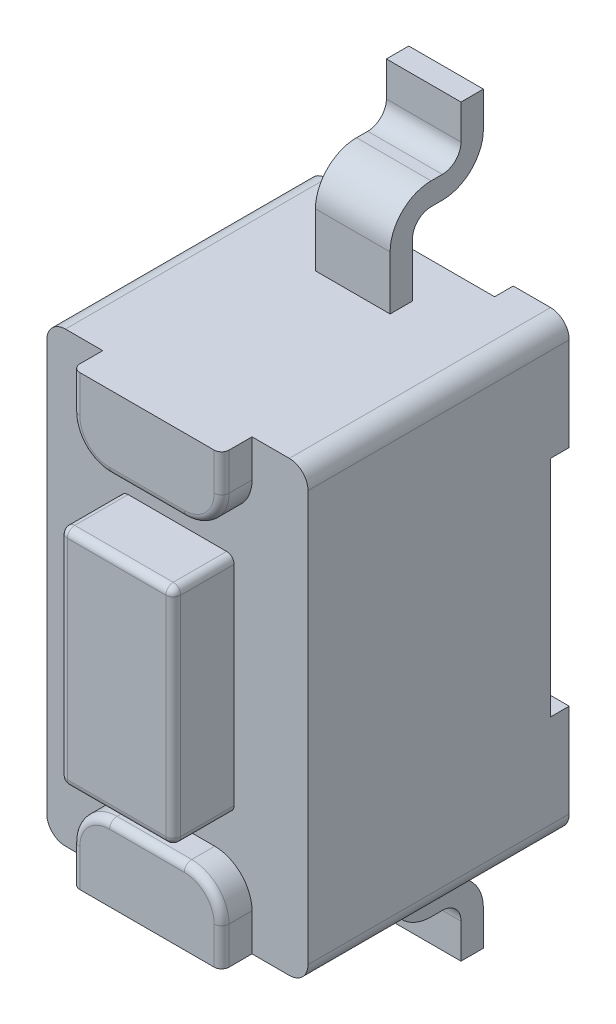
ISO-10303-21;
HEADER;
FILE_DESCRIPTION(('STEP AP214'),'2;1');
FILE_NAME('part.step','',(''),(''),'','','');
FILE_SCHEMA(('AUTOMOTIVE_DESIGN { 1 0 10303 214 1 1 1 1 }'));
ENDSEC;
DATA;
#1=APPLICATION_CONTEXT('core data for automotive mechanical design processes');
#2=APPLICATION_PROTOCOL_DEFINITION('international standard','automotive_design',2000,#1);
#3=PRODUCT_CONTEXT('',#1,'mechanical');
#4=PRODUCT('Part','Part','',(#3));
#5=PRODUCT_RELATED_PRODUCT_CATEGORY('part','',(#4));
#6=PRODUCT_DEFINITION_FORMATION('','',#4);
#7=PRODUCT_DEFINITION_CONTEXT('part definition',#1,'design');
#8=PRODUCT_DEFINITION('design','',#6,#7);
#9=PRODUCT_DEFINITION_SHAPE('','',#8);
#10=(LENGTH_UNIT() NAMED_UNIT(*) SI_UNIT(.MILLI.,.METRE.));
#11=(NAMED_UNIT(*) PLANE_ANGLE_UNIT() SI_UNIT($,.RADIAN.));
#12=(NAMED_UNIT(*) SI_UNIT($,.STERADIAN.) SOLID_ANGLE_UNIT());
#13=UNCERTAINTY_MEASURE_WITH_UNIT(LENGTH_MEASURE(1.E-05),#10,'distance_accuracy_value','');
#14=(GEOMETRIC_REPRESENTATION_CONTEXT(3) GLOBAL_UNCERTAINTY_ASSIGNED_CONTEXT((#13)) GLOBAL_UNIT_ASSIGNED_CONTEXT((#10,
#11,#12)) REPRESENTATION_CONTEXT('',''));
#15=CARTESIAN_POINT('',(0.,0.,0.));
#16=DIRECTION('',(0.,0.,1.));
#17=DIRECTION('',(1.,0.,0.));
#18=AXIS2_PLACEMENT_3D('',#15,#16,#17);
#19=CARTESIAN_POINT('',(-0.499999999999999,3.72,-3.715));
#20=DIRECTION('',(1.,0.,0.));
#21=DIRECTION('',(0.,0.,-1.));
#22=AXIS2_PLACEMENT_3D('',#19,#20,#21);
#23=CYLINDRICAL_SURFACE('',#22,0.249999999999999);
#24=CARTESIAN_POINT('',(0.499999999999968,3.72,-3.715));
#25=DIRECTION('',(1.,0.,0.));
#26=DIRECTION('',(0.,0.,-1.));
#27=AXIS2_PLACEMENT_3D('',#24,#25,#26);
#28=CIRCLE('',#27,0.249999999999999);
#29=CARTESIAN_POINT('',(0.499999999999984,3.72,-3.465));
#30=VERTEX_POINT('',#29);
#31=CARTESIAN_POINT('',(0.499999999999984,3.97,-3.71499999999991));
#32=VERTEX_POINT('',#31);
#33=EDGE_CURVE('E484',#30,#32,#28,.F.);
#34=ORIENTED_EDGE('',*,*,#33,.F.);
#35=DIRECTION('',(1.,0.,0.));
#36=VECTOR('',#35,1.);
#37=CARTESIAN_POINT('',(0.,3.72,-3.465));
#38=LINE('',#37,#36);
#39=CARTESIAN_POINT('',(-0.5,3.72,-3.465));
#40=VERTEX_POINT('',#39);
#41=EDGE_CURVE('E478',#40,#30,#38,.T.);
#42=ORIENTED_EDGE('',*,*,#41,.F.);
#43=CARTESIAN_POINT('',(-0.499999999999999,3.72,-3.715));
#44=DIRECTION('',(1.,0.,0.));
#45=DIRECTION('',(0.,0.,-1.));
#46=AXIS2_PLACEMENT_3D('',#43,#44,#45);
#47=CIRCLE('',#46,0.249999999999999);
#48=CARTESIAN_POINT('',(-0.5,3.97,-3.71499999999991));
#49=VERTEX_POINT('',#48);
#50=EDGE_CURVE('E20',#40,#49,#47,.F.);
#51=ORIENTED_EDGE('',*,*,#50,.T.);
#52=DIRECTION('',(-1.,0.,0.));
#53=VECTOR('',#52,1.);
#54=CARTESIAN_POINT('',(0.,3.97,-3.71499999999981));
#55=LINE('',#54,#53);
#56=EDGE_CURVE('E490',#32,#49,#55,.T.);
#57=ORIENTED_EDGE('',*,*,#56,.F.);
#58=EDGE_LOOP('',(#34,#42,#51,#57));
#59=FACE_BOUND('',#58,.T.);
#60=ADVANCED_FACE('F16',(#59),#23,.F.);
#61=CARTESIAN_POINT('',(-0.52,3.97,-3.70125891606));
#62=DIRECTION('',(0.,-1.,0.));
#63=DIRECTION('',(0.,0.,-1.));
#64=AXIS2_PLACEMENT_3D('',#61,#62,#63);
#65=PLANE('',#64);
#66=DIRECTION('',(0.,0.,-1.));
#67=VECTOR('',#66,1.);
#68=CARTESIAN_POINT('',(0.5,3.97,-3.79));
#69=LINE('',#68,#67);
#70=CARTESIAN_POINT('',(0.499999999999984,3.97,-3.86500000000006));
#71=VERTEX_POINT('',#70);
#72=EDGE_CURVE('E732',#32,#71,#69,.T.);
#73=ORIENTED_EDGE('',*,*,#72,.F.);
#74=ORIENTED_EDGE('',*,*,#56,.T.);
#75=DIRECTION('',(0.,0.,-1.));
#76=VECTOR('',#75,1.);
#77=CARTESIAN_POINT('',(-0.5,3.97,-3.79));
#78=LINE('',#77,#76);
#79=CARTESIAN_POINT('',(-0.499999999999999,3.97,-3.86500000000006));
#80=VERTEX_POINT('',#79);
#81=EDGE_CURVE('E470',#49,#80,#78,.T.);
#82=ORIENTED_EDGE('',*,*,#81,.T.);
#83=DIRECTION('',(1.,0.,0.));
#84=VECTOR('',#83,1.);
#85=CARTESIAN_POINT('',(0.,3.97,-3.86500000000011));
#86=LINE('',#85,#84);
#87=EDGE_CURVE('E915',#80,#71,#86,.T.);
#88=ORIENTED_EDGE('',*,*,#87,.T.);
#89=EDGE_LOOP('',(#73,#74,#82,#88));
#90=FACE_BOUND('',#89,.T.);
#91=ADVANCED_FACE('F924',(#90),#65,.T.);
#92=CARTESIAN_POINT('',(-0.499999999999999,4.52,-3.865));
#93=DIRECTION('',(1.,0.,0.));
#94=DIRECTION('',(0.,0.,-1.));
#95=AXIS2_PLACEMENT_3D('',#92,#93,#94);
#96=CYLINDRICAL_SURFACE('',#95,0.550000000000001);
#97=CARTESIAN_POINT('',(0.499999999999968,4.52,-3.865));
#98=DIRECTION('',(1.,0.,0.));
#99=DIRECTION('',(0.,0.,-1.));
#100=AXIS2_PLACEMENT_3D('',#97,#98,#99);
#101=CIRCLE('',#100,0.550000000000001);
#102=CARTESIAN_POINT('',(0.499999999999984,4.5199999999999,-4.415));
#103=VERTEX_POINT('',#102);
#104=EDGE_CURVE('E729',#71,#103,#101,.T.);
#105=ORIENTED_EDGE('',*,*,#104,.F.);
#106=ORIENTED_EDGE('',*,*,#87,.F.);
#107=CARTESIAN_POINT('',(-0.499999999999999,4.52,-3.865));
#108=DIRECTION('',(1.,0.,0.));
#109=DIRECTION('',(0.,0.,-1.));
#110=AXIS2_PLACEMENT_3D('',#107,#108,#109);
#111=CIRCLE('',#110,0.550000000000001);
#112=CARTESIAN_POINT('',(-0.5,4.5199999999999,-4.415));
#113=VERTEX_POINT('',#112);
#114=EDGE_CURVE('E739',#80,#113,#111,.T.);
#115=ORIENTED_EDGE('',*,*,#114,.T.);
#116=DIRECTION('',(-1.,0.,0.));
#117=VECTOR('',#116,1.);
#118=CARTESIAN_POINT('',(0.,4.51999999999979,-4.415));
#119=LINE('',#118,#117);
#120=EDGE_CURVE('E912',#103,#113,#119,.T.);
#121=ORIENTED_EDGE('',*,*,#120,.F.);
#122=EDGE_LOOP('',(#105,#106,#115,#121));
#123=FACE_BOUND('',#122,.T.);
#124=ADVANCED_FACE('F951',(#123),#96,.T.);
#125=CARTESIAN_POINT('',(-0.52,4.50625891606,-4.415));
#126=DIRECTION('',(0.,0.,-1.));
#127=DIRECTION('',(0.,1.,0.));
#128=AXIS2_PLACEMENT_3D('',#125,#126,#127);
#129=PLANE('',#128);
#130=DIRECTION('',(0.,1.,0.));
#131=VECTOR('',#130,1.);
#132=CARTESIAN_POINT('',(0.5,0.,-4.415));
#133=LINE('',#132,#131);
#134=CARTESIAN_POINT('',(0.5,4.9845,-4.41500000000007));
#135=VERTEX_POINT('',#134);
#136=EDGE_CURVE('E731',#103,#135,#133,.T.);
#137=ORIENTED_EDGE('',*,*,#136,.F.);
#138=ORIENTED_EDGE('',*,*,#120,.T.);
#139=DIRECTION('',(0.,1.,0.));
#140=VECTOR('',#139,1.);
#141=CARTESIAN_POINT('',(-0.5,0.,-4.415));
#142=LINE('',#141,#140);
#143=CARTESIAN_POINT('',(-0.5,4.9845,-4.41500000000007));
#144=VERTEX_POINT('',#143);
#145=EDGE_CURVE('E503',#113,#144,#142,.T.);
#146=ORIENTED_EDGE('',*,*,#145,.T.);
#147=DIRECTION('',(-1.,0.,0.));
#148=VECTOR('',#147,1.);
#149=CARTESIAN_POINT('',(0.,4.9845,-4.4150000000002));
#150=LINE('',#149,#148);
#151=EDGE_CURVE('E909',#135,#144,#150,.T.);
#152=ORIENTED_EDGE('',*,*,#151,.F.);
#153=EDGE_LOOP('',(#137,#138,#146,#152));
#154=FACE_BOUND('',#153,.T.);
#155=ADVANCED_FACE('F950',(#154),#129,.T.);
#156=CARTESIAN_POINT('',(-0.52,4.9845,-4.42874108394));
#157=DIRECTION('',(0.,1.,0.));
#158=DIRECTION('',(0.,0.,1.));
#159=AXIS2_PLACEMENT_3D('',#156,#157,#158);
#160=PLANE('',#159);
#161=DIRECTION('',(0.,0.,1.));
#162=VECTOR('',#161,1.);
#163=CARTESIAN_POINT('',(0.5,4.9845,-3.79));
#164=LINE('',#163,#162);
#165=CARTESIAN_POINT('',(0.5,4.98450000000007,-4.115));
#166=VERTEX_POINT('',#165);
#167=EDGE_CURVE('E878',#135,#166,#164,.T.);
#168=ORIENTED_EDGE('',*,*,#167,.F.);
#169=ORIENTED_EDGE('',*,*,#151,.T.);
#170=DIRECTION('',(0.,0.,1.));
#171=VECTOR('',#170,1.);
#172=CARTESIAN_POINT('',(-0.5,4.9845,-3.79));
#173=LINE('',#172,#171);
#174=CARTESIAN_POINT('',(-0.5,4.98450000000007,-4.115));
#175=VERTEX_POINT('',#174);
#176=EDGE_CURVE('E499',#144,#175,#173,.T.);
#177=ORIENTED_EDGE('',*,*,#176,.T.);
#178=DIRECTION('',(-1.,0.,0.));
#179=VECTOR('',#178,1.);
#180=CARTESIAN_POINT('',(0.,4.98450000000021,-4.115));
#181=LINE('',#180,#179);
#182=EDGE_CURVE('E900',#166,#175,#181,.T.);
#183=ORIENTED_EDGE('',*,*,#182,.F.);
#184=EDGE_LOOP('',(#168,#169,#177,#183));
#185=FACE_BOUND('',#184,.T.);
#186=ADVANCED_FACE('F907',(#185),#160,.T.);
#187=CARTESIAN_POINT('',(-0.52,4.99824108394,-4.115));
#188=DIRECTION('',(0.,0.,1.));
#189=DIRECTION('',(0.,-1.,0.));
#190=AXIS2_PLACEMENT_3D('',#187,#188,#189);
#191=PLANE('',#190);
#192=DIRECTION('',(0.,-1.,0.));
#193=VECTOR('',#192,1.);
#194=CARTESIAN_POINT('',(0.5,0.,-4.115));
#195=LINE('',#194,#193);
#196=CARTESIAN_POINT('',(0.499999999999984,4.52000000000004,-4.115));
#197=VERTEX_POINT('',#196);
#198=EDGE_CURVE('E728',#166,#197,#195,.T.);
#199=ORIENTED_EDGE('',*,*,#198,.F.);
#200=ORIENTED_EDGE('',*,*,#182,.T.);
#201=DIRECTION('',(0.,-1.,0.));
#202=VECTOR('',#201,1.);
#203=CARTESIAN_POINT('',(-0.5,0.,-4.115));
#204=LINE('',#203,#202);
#205=CARTESIAN_POINT('',(-0.5,4.52000000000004,-4.115));
#206=VERTEX_POINT('',#205);
#207=EDGE_CURVE('E502',#175,#206,#204,.T.);
#208=ORIENTED_EDGE('',*,*,#207,.T.);
#209=DIRECTION('',(-1.,0.,0.));
#210=VECTOR('',#209,1.);
#211=CARTESIAN_POINT('',(0.,4.52000000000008,-4.115));
#212=LINE('',#211,#210);
#213=EDGE_CURVE('E897',#197,#206,#212,.T.);
#214=ORIENTED_EDGE('',*,*,#213,.F.);
#215=EDGE_LOOP('',(#199,#200,#208,#214));
#216=FACE_BOUND('',#215,.T.);
#217=ADVANCED_FACE('F896',(#216),#191,.T.);
#218=CARTESIAN_POINT('',(-0.499999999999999,4.52,-3.865));
#219=DIRECTION('',(1.,0.,0.));
#220=DIRECTION('',(0.,0.,-1.));
#221=AXIS2_PLACEMENT_3D('',#218,#219,#220);
#222=CYLINDRICAL_SURFACE('',#221,0.250000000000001);
#223=CARTESIAN_POINT('',(0.499999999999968,4.52,-3.865));
#224=DIRECTION('',(1.,0.,0.));
#225=DIRECTION('',(0.,0.,-1.));
#226=AXIS2_PLACEMENT_3D('',#223,#224,#225);
#227=CIRCLE('',#226,0.250000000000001);
#228=CARTESIAN_POINT('',(0.499999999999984,4.27,-3.86500000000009));
#229=VERTEX_POINT('',#228);
#230=EDGE_CURVE('E726',#197,#229,#227,.F.);
#231=ORIENTED_EDGE('',*,*,#230,.F.);
#232=ORIENTED_EDGE('',*,*,#213,.T.);
#233=CARTESIAN_POINT('',(-0.499999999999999,4.52,-3.865));
#234=DIRECTION('',(1.,0.,0.));
#235=DIRECTION('',(0.,0.,-1.));
#236=AXIS2_PLACEMENT_3D('',#233,#234,#235);
#237=CIRCLE('',#236,0.250000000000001);
#238=CARTESIAN_POINT('',(-0.5,4.27,-3.86500000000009));
#239=VERTEX_POINT('',#238);
#240=EDGE_CURVE('E737',#206,#239,#237,.F.);
#241=ORIENTED_EDGE('',*,*,#240,.T.);
#242=DIRECTION('',(-1.,0.,0.));
#243=VECTOR('',#242,1.);
#244=CARTESIAN_POINT('',(0.,4.27,-3.86500000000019));
#245=LINE('',#244,#243);
#246=EDGE_CURVE('E946',#229,#239,#245,.T.);
#247=ORIENTED_EDGE('',*,*,#246,.F.);
#248=EDGE_LOOP('',(#231,#232,#241,#247));
#249=FACE_BOUND('',#248,.T.);
#250=ADVANCED_FACE('F1715',(#249),#222,.F.);
#251=CARTESIAN_POINT('',(-0.52,4.27,-3.87874108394));
#252=DIRECTION('',(0.,1.,0.));
#253=DIRECTION('',(0.,0.,1.));
#254=AXIS2_PLACEMENT_3D('',#251,#252,#253);
#255=PLANE('',#254);
#256=DIRECTION('',(0.,0.,1.));
#257=VECTOR('',#256,1.);
#258=CARTESIAN_POINT('',(0.5,4.27,-3.79));
#259=LINE('',#258,#257);
#260=CARTESIAN_POINT('',(0.499999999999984,4.27,-3.715));
#261=VERTEX_POINT('',#260);
#262=EDGE_CURVE('E725',#229,#261,#259,.T.);
#263=ORIENTED_EDGE('',*,*,#262,.F.);
#264=ORIENTED_EDGE('',*,*,#246,.T.);
#265=DIRECTION('',(0.,0.,1.));
#266=VECTOR('',#265,1.);
#267=CARTESIAN_POINT('',(-0.5,4.27,-3.79));
#268=LINE('',#267,#266);
#269=CARTESIAN_POINT('',(-0.5,4.27,-3.715));
#270=VERTEX_POINT('',#269);
#271=EDGE_CURVE('E736',#239,#270,#268,.T.);
#272=ORIENTED_EDGE('',*,*,#271,.T.);
#273=DIRECTION('',(1.,0.,0.));
#274=VECTOR('',#273,1.);
#275=CARTESIAN_POINT('',(0.,4.27,-3.715));
#276=LINE('',#275,#274);
#277=EDGE_CURVE('E943',#270,#261,#276,.T.);
#278=ORIENTED_EDGE('',*,*,#277,.T.);
#279=EDGE_LOOP('',(#263,#264,#272,#278));
#280=FACE_BOUND('',#279,.T.);
#281=ADVANCED_FACE('F1707',(#280),#255,.T.);
#282=CARTESIAN_POINT('',(-0.499999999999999,3.72,-3.715));
#283=DIRECTION('',(1.,0.,0.));
#284=DIRECTION('',(0.,0.,-1.));
#285=AXIS2_PLACEMENT_3D('',#282,#283,#284);
#286=CYLINDRICAL_SURFACE('',#285,0.55);
#287=CARTESIAN_POINT('',(0.499999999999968,3.72,-3.715));
#288=DIRECTION('',(1.,0.,0.));
#289=DIRECTION('',(0.,0.,-1.));
#290=AXIS2_PLACEMENT_3D('',#287,#288,#289);
#291=CIRCLE('',#290,0.55);
#292=CARTESIAN_POINT('',(0.499999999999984,3.72,-3.165));
#293=VERTEX_POINT('',#292);
#294=EDGE_CURVE('E722',#261,#293,#291,.T.);
#295=ORIENTED_EDGE('',*,*,#294,.F.);
#296=ORIENTED_EDGE('',*,*,#277,.F.);
#297=CARTESIAN_POINT('',(-0.499999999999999,3.72,-3.715));
#298=DIRECTION('',(1.,0.,0.));
#299=DIRECTION('',(0.,0.,-1.));
#300=AXIS2_PLACEMENT_3D('',#297,#298,#299);
#301=CIRCLE('',#300,0.55);
#302=CARTESIAN_POINT('',(-0.5,3.72,-3.165));
#303=VERTEX_POINT('',#302);
#304=EDGE_CURVE('E481',#270,#303,#301,.T.);
#305=ORIENTED_EDGE('',*,*,#304,.T.);
#306=DIRECTION('',(-1.,0.,0.));
#307=VECTOR('',#306,1.);
#308=CARTESIAN_POINT('',(0.,3.72,-3.165));
#309=LINE('',#308,#307);
#310=EDGE_CURVE('E1401',#293,#303,#309,.T.);
#311=ORIENTED_EDGE('',*,*,#310,.F.);
#312=EDGE_LOOP('',(#295,#296,#305,#311));
#313=FACE_BOUND('',#312,.T.);
#314=ADVANCED_FACE('F1699',(#313),#286,.T.);
#315=CARTESIAN_POINT('',(-0.6864,-1.456,0.));
#316=DIRECTION('',(0.,0.,1.));
#317=DIRECTION('',(1.,0.,0.));
#318=AXIS2_PLACEMENT_3D('',#315,#316,#317);
#319=PLANE('',#318);
#320=DIRECTION('',(1.,0.,0.));
#321=VECTOR('',#320,1.);
#322=CARTESIAN_POINT('',(0.,-1.4,0.));
#323=LINE('',#322,#321);
#324=CARTESIAN_POINT('',(-0.66,-1.39999999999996,0.));
#325=VERTEX_POINT('',#324);
#326=CARTESIAN_POINT('',(0.659999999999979,-1.4,0.));
#327=VERTEX_POINT('',#326);
#328=EDGE_CURVE('E712',#325,#327,#323,.T.);
#329=ORIENTED_EDGE('',*,*,#328,.T.);
#330=DIRECTION('',(0.,1.,0.));
#331=VECTOR('',#330,1.);
#332=CARTESIAN_POINT('',(0.66,0.,0.));
#333=LINE('',#332,#331);
#334=CARTESIAN_POINT('',(0.66,1.4,0.));
#335=VERTEX_POINT('',#334);
#336=EDGE_CURVE('E713',#327,#335,#333,.T.);
#337=ORIENTED_EDGE('',*,*,#336,.T.);
#338=DIRECTION('',(-1.,0.,0.));
#339=VECTOR('',#338,1.);
#340=CARTESIAN_POINT('',(0.,1.4,0.));
#341=LINE('',#340,#339);
#342=CARTESIAN_POINT('',(-0.659999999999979,1.4,0.));
#343=VERTEX_POINT('',#342);
#344=EDGE_CURVE('E827',#335,#343,#341,.T.);
#345=ORIENTED_EDGE('',*,*,#344,.T.);
#346=DIRECTION('',(0.,-1.,0.));
#347=VECTOR('',#346,1.);
#348=CARTESIAN_POINT('',(-0.66,0.,0.));
#349=LINE('',#348,#347);
#350=EDGE_CURVE('E707',#343,#325,#349,.T.);
#351=ORIENTED_EDGE('',*,*,#350,.T.);
#352=EDGE_LOOP('',(#329,#337,#345,#351));
#353=FACE_BOUND('',#352,.T.);
#354=ADVANCED_FACE('F1691',(#353),#319,.T.);
#355=CARTESIAN_POINT('',(-0.499999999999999,-3.72,-3.715));
#356=DIRECTION('',(1.,0.,0.));
#357=DIRECTION('',(0.,0.,-1.));
#358=AXIS2_PLACEMENT_3D('',#355,#356,#357);
#359=CYLINDRICAL_SURFACE('',#358,0.55);
#360=CARTESIAN_POINT('',(0.499999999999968,-3.72,-3.715));
#361=DIRECTION('',(1.,0.,0.));
#362=DIRECTION('',(0.,0.,-1.));
#363=AXIS2_PLACEMENT_3D('',#360,#361,#362);
#364=CIRCLE('',#363,0.55);
#365=CARTESIAN_POINT('',(0.499999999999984,-3.72,-3.165));
#366=VERTEX_POINT('',#365);
#367=CARTESIAN_POINT('',(0.499999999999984,-4.27,-3.71499999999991));
#368=VERTEX_POINT('',#367);
#369=EDGE_CURVE('E668',#366,#368,#364,.T.);
#370=ORIENTED_EDGE('',*,*,#369,.F.);
#371=DIRECTION('',(1.,0.,0.));
#372=VECTOR('',#371,1.);
#373=CARTESIAN_POINT('',(0.,-3.72,-3.165));
#374=LINE('',#373,#372);
#375=CARTESIAN_POINT('',(-0.5,-3.72,-3.165));
#376=VERTEX_POINT('',#375);
#377=EDGE_CURVE('E828',#376,#366,#374,.T.);
#378=ORIENTED_EDGE('',*,*,#377,.F.);
#379=CARTESIAN_POINT('',(-0.499999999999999,-3.72,-3.715));
#380=DIRECTION('',(1.,0.,0.));
#381=DIRECTION('',(0.,0.,-1.));
#382=AXIS2_PLACEMENT_3D('',#379,#380,#381);
#383=CIRCLE('',#382,0.55);
#384=CARTESIAN_POINT('',(-0.5,-4.27,-3.71499999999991));
#385=VERTEX_POINT('',#384);
#386=EDGE_CURVE('E685',#376,#385,#383,.T.);
#387=ORIENTED_EDGE('',*,*,#386,.T.);
#388=DIRECTION('',(-1.,0.,0.));
#389=VECTOR('',#388,1.);
#390=CARTESIAN_POINT('',(0.,-4.27,-3.71499999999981));
#391=LINE('',#390,#389);
#392=EDGE_CURVE('E825',#368,#385,#391,.T.);
#393=ORIENTED_EDGE('',*,*,#392,.F.);
#394=EDGE_LOOP('',(#370,#378,#387,#393));
#395=FACE_BOUND('',#394,.T.);
#396=ADVANCED_FACE('F1683',(#395),#359,.T.);
#397=CARTESIAN_POINT('',(-0.52,-4.27,-3.70125891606));
#398=DIRECTION('',(0.,-1.,0.));
#399=DIRECTION('',(0.,0.,-1.));
#400=AXIS2_PLACEMENT_3D('',#397,#398,#399);
#401=PLANE('',#400);
#402=DIRECTION('',(0.,0.,-1.));
#403=VECTOR('',#402,1.);
#404=CARTESIAN_POINT('',(0.5,-4.27,-3.79));
#405=LINE('',#404,#403);
#406=CARTESIAN_POINT('',(0.499999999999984,-4.27,-3.86499999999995));
#407=VERTEX_POINT('',#406);
#408=EDGE_CURVE('E667',#368,#407,#405,.T.);
#409=ORIENTED_EDGE('',*,*,#408,.F.);
#410=ORIENTED_EDGE('',*,*,#392,.T.);
#411=DIRECTION('',(0.,0.,-1.));
#412=VECTOR('',#411,1.);
#413=CARTESIAN_POINT('',(-0.5,-4.27,-3.79));
#414=LINE('',#413,#412);
#415=CARTESIAN_POINT('',(-0.5,-4.27,-3.86499999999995));
#416=VERTEX_POINT('',#415);
#417=EDGE_CURVE('E684',#385,#416,#414,.T.);
#418=ORIENTED_EDGE('',*,*,#417,.T.);
#419=DIRECTION('',(-1.,0.,0.));
#420=VECTOR('',#419,1.);
#421=CARTESIAN_POINT('',(0.,-4.27,-3.8649999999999));
#422=LINE('',#421,#420);
#423=EDGE_CURVE('E823',#407,#416,#422,.T.);
#424=ORIENTED_EDGE('',*,*,#423,.F.);
#425=EDGE_LOOP('',(#409,#410,#418,#424));
#426=FACE_BOUND('',#425,.T.);
#427=ADVANCED_FACE('F1675',(#426),#401,.T.);
#428=CARTESIAN_POINT('',(-0.499999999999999,-4.52,-3.865));
#429=DIRECTION('',(1.,0.,0.));
#430=DIRECTION('',(0.,0.,-1.));
#431=AXIS2_PLACEMENT_3D('',#428,#429,#430);
#432=CYLINDRICAL_SURFACE('',#431,0.249999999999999);
#433=CARTESIAN_POINT('',(0.499999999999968,-4.52,-3.865));
#434=DIRECTION('',(1.,0.,0.));
#435=DIRECTION('',(0.,0.,-1.));
#436=AXIS2_PLACEMENT_3D('',#433,#434,#435);
#437=CIRCLE('',#436,0.249999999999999);
#438=CARTESIAN_POINT('',(0.499999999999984,-4.5199999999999,-4.115));
#439=VERTEX_POINT('',#438);
#440=EDGE_CURVE('E664',#407,#439,#437,.F.);
#441=ORIENTED_EDGE('',*,*,#440,.F.);
#442=ORIENTED_EDGE('',*,*,#423,.T.);
#443=CARTESIAN_POINT('',(-0.499999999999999,-4.52,-3.865));
#444=DIRECTION('',(1.,0.,0.));
#445=DIRECTION('',(0.,0.,-1.));
#446=AXIS2_PLACEMENT_3D('',#443,#444,#445);
#447=CIRCLE('',#446,0.249999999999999);
#448=CARTESIAN_POINT('',(-0.5,-4.5199999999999,-4.115));
#449=VERTEX_POINT('',#448);
#450=EDGE_CURVE('E680',#416,#449,#447,.F.);
#451=ORIENTED_EDGE('',*,*,#450,.T.);
#452=DIRECTION('',(-1.,0.,0.));
#453=VECTOR('',#452,1.);
#454=CARTESIAN_POINT('',(0.,-4.51999999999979,-4.115));
#455=LINE('',#454,#453);
#456=EDGE_CURVE('E819',#439,#449,#455,.T.);
#457=ORIENTED_EDGE('',*,*,#456,.F.);
#458=EDGE_LOOP('',(#441,#442,#451,#457));
#459=FACE_BOUND('',#458,.T.);
#460=ADVANCED_FACE('F1667',(#459),#432,.F.);
#461=CARTESIAN_POINT('',(-0.52,-4.50625891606,-4.115));
#462=DIRECTION('',(0.,0.,1.));
#463=DIRECTION('',(0.,-1.,0.));
#464=AXIS2_PLACEMENT_3D('',#461,#462,#463);
#465=PLANE('',#464);
#466=DIRECTION('',(0.,-1.,0.));
#467=VECTOR('',#466,1.);
#468=CARTESIAN_POINT('',(0.5,0.,-4.115));
#469=LINE('',#468,#467);
#470=CARTESIAN_POINT('',(0.5,-4.9845,-4.11499999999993));
#471=VERTEX_POINT('',#470);
#472=EDGE_CURVE('E666',#439,#471,#469,.T.);
#473=ORIENTED_EDGE('',*,*,#472,.F.);
#474=ORIENTED_EDGE('',*,*,#456,.T.);
#475=DIRECTION('',(0.,-1.,0.));
#476=VECTOR('',#475,1.);
#477=CARTESIAN_POINT('',(-0.5,0.,-4.115));
#478=LINE('',#477,#476);
#479=CARTESIAN_POINT('',(-0.5,-4.9845,-4.11499999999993));
#480=VERTEX_POINT('',#479);
#481=EDGE_CURVE('E683',#449,#480,#478,.T.);
#482=ORIENTED_EDGE('',*,*,#481,.T.);
#483=DIRECTION('',(-1.,0.,0.));
#484=VECTOR('',#483,1.);
#485=CARTESIAN_POINT('',(0.,-4.9845,-4.1149999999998));
#486=LINE('',#485,#484);
#487=EDGE_CURVE('E811',#471,#480,#486,.T.);
#488=ORIENTED_EDGE('',*,*,#487,.F.);
#489=EDGE_LOOP('',(#473,#474,#482,#488));
#490=FACE_BOUND('',#489,.T.);
#491=ADVANCED_FACE('F1659',(#490),#465,.T.);
#492=CARTESIAN_POINT('',(-0.52,-4.9845,-4.10125891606));
#493=DIRECTION('',(0.,-1.,0.));
#494=DIRECTION('',(0.,0.,-1.));
#495=AXIS2_PLACEMENT_3D('',#492,#493,#494);
#496=PLANE('',#495);
#497=DIRECTION('',(0.,0.,-1.));
#498=VECTOR('',#497,1.);
#499=CARTESIAN_POINT('',(0.5,-4.9845,-3.79));
#500=LINE('',#499,#498);
#501=CARTESIAN_POINT('',(0.5,-4.98450000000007,-4.415));
#502=VERTEX_POINT('',#501);
#503=EDGE_CURVE('E814',#471,#502,#500,.T.);
#504=ORIENTED_EDGE('',*,*,#503,.F.);
#505=ORIENTED_EDGE('',*,*,#487,.T.);
#506=DIRECTION('',(0.,0.,-1.));
#507=VECTOR('',#506,1.);
#508=CARTESIAN_POINT('',(-0.5,-4.9845,-3.79));
#509=LINE('',#508,#507);
#510=CARTESIAN_POINT('',(-0.5,-4.98450000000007,-4.415));
#511=VERTEX_POINT('',#510);
#512=EDGE_CURVE('E837',#480,#511,#509,.T.);
#513=ORIENTED_EDGE('',*,*,#512,.T.);
#514=DIRECTION('',(-1.,0.,0.));
#515=VECTOR('',#514,1.);
#516=CARTESIAN_POINT('',(0.,-4.98450000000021,-4.415));
#517=LINE('',#516,#515);
#518=EDGE_CURVE('E809',#502,#511,#517,.T.);
#519=ORIENTED_EDGE('',*,*,#518,.F.);
#520=EDGE_LOOP('',(#504,#505,#513,#519));
#521=FACE_BOUND('',#520,.T.);
#522=ADVANCED_FACE('F1652',(#521),#496,.T.);
#523=CARTESIAN_POINT('',(-0.52,-4.99824108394,-4.415));
#524=DIRECTION('',(0.,0.,-1.));
#525=DIRECTION('',(0.,1.,0.));
#526=AXIS2_PLACEMENT_3D('',#523,#524,#525);
#527=PLANE('',#526);
#528=DIRECTION('',(0.,1.,0.));
#529=VECTOR('',#528,1.);
#530=CARTESIAN_POINT('',(0.5,0.,-4.415));
#531=LINE('',#530,#529);
#532=CARTESIAN_POINT('',(0.499999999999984,-4.51999999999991,-4.415));
#533=VERTEX_POINT('',#532);
#534=EDGE_CURVE('E663',#502,#533,#531,.T.);
#535=ORIENTED_EDGE('',*,*,#534,.F.);
#536=ORIENTED_EDGE('',*,*,#518,.T.);
#537=DIRECTION('',(0.,1.,0.));
#538=VECTOR('',#537,1.);
#539=CARTESIAN_POINT('',(-0.5,0.,-4.415));
#540=LINE('',#539,#538);
#541=CARTESIAN_POINT('',(-0.5,-4.51999999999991,-4.415));
#542=VERTEX_POINT('',#541);
#543=EDGE_CURVE('E679',#511,#542,#540,.T.);
#544=ORIENTED_EDGE('',*,*,#543,.T.);
#545=DIRECTION('',(1.,0.,0.));
#546=VECTOR('',#545,1.);
#547=CARTESIAN_POINT('',(0.,-4.51999999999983,-4.415));
#548=LINE('',#547,#546);
#549=EDGE_CURVE('E806',#542,#533,#548,.T.);
#550=ORIENTED_EDGE('',*,*,#549,.T.);
#551=EDGE_LOOP('',(#535,#536,#544,#550));
#552=FACE_BOUND('',#551,.T.);
#553=ADVANCED_FACE('F1644',(#552),#527,.T.);
#554=CARTESIAN_POINT('',(-0.499999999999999,-4.52,-3.865));
#555=DIRECTION('',(1.,0.,0.));
#556=DIRECTION('',(0.,0.,-1.));
#557=AXIS2_PLACEMENT_3D('',#554,#555,#556);
#558=CYLINDRICAL_SURFACE('',#557,0.55);
#559=CARTESIAN_POINT('',(0.499999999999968,-4.52,-3.865));
#560=DIRECTION('',(1.,0.,0.));
#561=DIRECTION('',(0.,0.,-1.));
#562=AXIS2_PLACEMENT_3D('',#559,#560,#561);
#563=CIRCLE('',#562,0.55);
#564=CARTESIAN_POINT('',(0.499999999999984,-3.97,-3.86500000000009));
#565=VERTEX_POINT('',#564);
#566=EDGE_CURVE('E661',#533,#565,#563,.T.);
#567=ORIENTED_EDGE('',*,*,#566,.F.);
#568=ORIENTED_EDGE('',*,*,#549,.F.);
#569=CARTESIAN_POINT('',(-0.499999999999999,-4.52,-3.865));
#570=DIRECTION('',(1.,0.,0.));
#571=DIRECTION('',(0.,0.,-1.));
#572=AXIS2_PLACEMENT_3D('',#569,#570,#571);
#573=CIRCLE('',#572,0.55);
#574=CARTESIAN_POINT('',(-0.5,-3.97,-3.86500000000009));
#575=VERTEX_POINT('',#574);
#576=EDGE_CURVE('E676',#542,#575,#573,.T.);
#577=ORIENTED_EDGE('',*,*,#576,.T.);
#578=DIRECTION('',(-1.,0.,0.));
#579=VECTOR('',#578,1.);
#580=CARTESIAN_POINT('',(0.,-3.97,-3.86500000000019));
#581=LINE('',#580,#579);
#582=EDGE_CURVE('E804',#565,#575,#581,.T.);
#583=ORIENTED_EDGE('',*,*,#582,.F.);
#584=EDGE_LOOP('',(#567,#568,#577,#583));
#585=FACE_BOUND('',#584,.T.);
#586=ADVANCED_FACE('F1637',(#585),#558,.T.);
#587=CARTESIAN_POINT('',(-0.52,-3.97,-3.87874108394));
#588=DIRECTION('',(0.,1.,0.));
#589=DIRECTION('',(0.,0.,1.));
#590=AXIS2_PLACEMENT_3D('',#587,#588,#589);
#591=PLANE('',#590);
#592=DIRECTION('',(0.,0.,1.));
#593=VECTOR('',#592,1.);
#594=CARTESIAN_POINT('',(0.5,-3.97,-3.79));
#595=LINE('',#594,#593);
#596=CARTESIAN_POINT('',(0.499999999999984,-3.97,-3.71500000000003));
#597=VERTEX_POINT('',#596);
#598=EDGE_CURVE('E660',#565,#597,#595,.T.);
#599=ORIENTED_EDGE('',*,*,#598,.F.);
#600=ORIENTED_EDGE('',*,*,#582,.T.);
#601=DIRECTION('',(0.,0.,1.));
#602=VECTOR('',#601,1.);
#603=CARTESIAN_POINT('',(-0.5,-3.97,-3.79));
#604=LINE('',#603,#602);
#605=CARTESIAN_POINT('',(-0.499999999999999,-3.97,-3.71500000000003));
#606=VERTEX_POINT('',#605);
#607=EDGE_CURVE('E675',#575,#606,#604,.T.);
#608=ORIENTED_EDGE('',*,*,#607,.T.);
#609=DIRECTION('',(-1.,0.,0.));
#610=VECTOR('',#609,1.);
#611=CARTESIAN_POINT('',(0.,-3.97,-3.71500000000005));
#612=LINE('',#611,#610);
#613=EDGE_CURVE('E474',#597,#606,#612,.T.);
#614=ORIENTED_EDGE('',*,*,#613,.F.);
#615=EDGE_LOOP('',(#599,#600,#608,#614));
#616=FACE_BOUND('',#615,.T.);
#617=ADVANCED_FACE('F529',(#616),#591,.T.);
#618=CARTESIAN_POINT('',(-0.499999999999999,-3.72,-3.715));
#619=DIRECTION('',(1.,0.,0.));
#620=DIRECTION('',(0.,0.,-1.));
#621=AXIS2_PLACEMENT_3D('',#618,#619,#620);
#622=CYLINDRICAL_SURFACE('',#621,0.25);
#623=CARTESIAN_POINT('',(0.499999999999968,-3.72,-3.715));
#624=DIRECTION('',(1.,0.,0.));
#625=DIRECTION('',(0.,0.,-1.));
#626=AXIS2_PLACEMENT_3D('',#623,#624,#625);
#627=CIRCLE('',#626,0.25);
#628=CARTESIAN_POINT('',(0.499999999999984,-3.72,-3.465));
#629=VERTEX_POINT('',#628);
#630=EDGE_CURVE('E657',#597,#629,#627,.F.);
#631=ORIENTED_EDGE('',*,*,#630,.F.);
#632=ORIENTED_EDGE('',*,*,#613,.T.);
#633=CARTESIAN_POINT('',(-0.499999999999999,-3.72,-3.715));
#634=DIRECTION('',(1.,0.,0.));
#635=DIRECTION('',(0.,0.,-1.));
#636=AXIS2_PLACEMENT_3D('',#633,#634,#635);
#637=CIRCLE('',#636,0.25);
#638=CARTESIAN_POINT('',(-0.5,-3.72,-3.465));
#639=VERTEX_POINT('',#638);
#640=EDGE_CURVE('E671',#606,#639,#637,.F.);
#641=ORIENTED_EDGE('',*,*,#640,.T.);
#642=DIRECTION('',(-1.,0.,0.));
#643=VECTOR('',#642,1.);
#644=CARTESIAN_POINT('',(0.,-3.72,-3.465));
#645=LINE('',#644,#643);
#646=EDGE_CURVE('E778',#629,#639,#645,.T.);
#647=ORIENTED_EDGE('',*,*,#646,.F.);
#648=EDGE_LOOP('',(#631,#632,#641,#647));
#649=FACE_BOUND('',#648,.T.);
#650=ADVANCED_FACE('F528',(#649),#622,.F.);
#651=CARTESIAN_POINT('',(-0.936,-3.12,-0.4075));
#652=DIRECTION('',(0.,0.,1.));
#653=DIRECTION('',(1.,0.,0.));
#654=AXIS2_PLACEMENT_3D('',#651,#652,#653);
#655=PLANE('',#654);
#656=DIRECTION('',(1.,0.,0.));
#657=VECTOR('',#656,1.);
#658=CARTESIAN_POINT('',(0.,2.1,-0.4075));
#659=LINE('',#658,#657);
#660=CARTESIAN_POINT('',(-0.4999999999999,2.1,-0.4075));
#661=VERTEX_POINT('',#660);
#662=CARTESIAN_POINT('',(0.499999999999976,2.1000000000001,-0.4075));
#663=VERTEX_POINT('',#662);
#664=EDGE_CURVE('E1423',#661,#663,#659,.T.);
#665=ORIENTED_EDGE('',*,*,#664,.T.);
#666=CARTESIAN_POINT('',(0.5,2.5,-0.4075));
#667=DIRECTION('',(0.,0.,-1.));
#668=DIRECTION('',(1.,2.9598719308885E-13,0.));
#669=AXIS2_PLACEMENT_3D('',#666,#667,#668);
#670=CIRCLE('',#669,0.399999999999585);
#671=CARTESIAN_POINT('',(0.899999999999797,2.50000000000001,-0.4075));
#672=VERTEX_POINT('',#671);
#673=EDGE_CURVE('E511',#663,#672,#670,.F.);
#674=ORIENTED_EDGE('',*,*,#673,.T.);
#675=DIRECTION('',(0.,1.,0.));
#676=VECTOR('',#675,1.);
#677=CARTESIAN_POINT('',(0.9,2.75,-0.4075));
#678=LINE('',#677,#676);
#679=CARTESIAN_POINT('',(0.9,3.0000000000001,-0.4075));
#680=VERTEX_POINT('',#679);
#681=EDGE_CURVE('E767',#672,#680,#678,.T.);
#682=ORIENTED_EDGE('',*,*,#681,.T.);
#683=DIRECTION('',(1.,0.,0.));
#684=VECTOR('',#683,1.);
#685=CARTESIAN_POINT('',(0.,3.,-0.4075));
#686=LINE('',#685,#684);
#687=CARTESIAN_POINT('',(-0.9,3.00000000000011,-0.4075));
#688=VERTEX_POINT('',#687);
#689=EDGE_CURVE('E652',#688,#680,#686,.T.);
#690=ORIENTED_EDGE('',*,*,#689,.F.);
#691=DIRECTION('',(0.,-1.,0.));
#692=VECTOR('',#691,1.);
#693=CARTESIAN_POINT('',(-0.9,2.75,-0.4075));
#694=LINE('',#693,#692);
#695=CARTESIAN_POINT('',(-0.899999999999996,2.50000000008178,-0.4075));
#696=VERTEX_POINT('',#695);
#697=EDGE_CURVE('E771',#688,#696,#694,.T.);
#698=ORIENTED_EDGE('',*,*,#697,.T.);
#699=CARTESIAN_POINT('',(-0.5,2.5,-0.4075));
#700=DIRECTION('',(0.,0.,-1.));
#701=DIRECTION('',(3.31765864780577E-13,-1.,0.));
#702=AXIS2_PLACEMENT_3D('',#699,#700,#701);
#703=CIRCLE('',#702,0.399999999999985);
#704=EDGE_CURVE('E1483',#696,#661,#703,.F.);
#705=ORIENTED_EDGE('',*,*,#704,.T.);
#706=EDGE_LOOP('',(#665,#674,#682,#690,#698,#705));
#707=FACE_BOUND('',#706,.T.);
#708=ADVANCED_FACE('F518',(#707),#655,.T.);
#709=CARTESIAN_POINT('',(-0.5,-5.18388,-4.44));
#710=DIRECTION('',(1.,0.,0.));
#711=DIRECTION('',(0.,1.,0.));
#712=AXIS2_PLACEMENT_3D('',#709,#710,#711);
#713=PLANE('',#712);
#714=ORIENTED_EDGE('',*,*,#304,.F.);
#715=ORIENTED_EDGE('',*,*,#271,.F.);
#716=ORIENTED_EDGE('',*,*,#240,.F.);
#717=ORIENTED_EDGE('',*,*,#207,.F.);
#718=ORIENTED_EDGE('',*,*,#176,.F.);
#719=ORIENTED_EDGE('',*,*,#145,.F.);
#720=ORIENTED_EDGE('',*,*,#114,.F.);
#721=ORIENTED_EDGE('',*,*,#81,.F.);
#722=ORIENTED_EDGE('',*,*,#50,.F.);
#723=DIRECTION('',(0.,1.,0.));
#724=VECTOR('',#723,1.);
#725=CARTESIAN_POINT('',(-0.5,3.36,-3.465));
#726=LINE('',#725,#724);
#727=CARTESIAN_POINT('',(-0.5,3.,-3.465));
#728=VERTEX_POINT('',#727);
#729=EDGE_CURVE('E466',#728,#40,#726,.T.);
#730=ORIENTED_EDGE('',*,*,#729,.F.);
#731=DIRECTION('',(0.,0.,-1.));
#732=VECTOR('',#731,1.);
#733=CARTESIAN_POINT('',(-0.5,3.,-2.36125));
#734=LINE('',#733,#732);
#735=CARTESIAN_POINT('',(-0.5,3.,-3.165));
#736=VERTEX_POINT('',#735);
#737=EDGE_CURVE('E494',#736,#728,#734,.T.);
#738=ORIENTED_EDGE('',*,*,#737,.F.);
#739=DIRECTION('',(0.,-1.,0.));
#740=VECTOR('',#739,1.);
#741=CARTESIAN_POINT('',(-0.5,3.36,-3.165));
#742=LINE('',#741,#740);
#743=EDGE_CURVE('E775',#303,#736,#742,.T.);
#744=ORIENTED_EDGE('',*,*,#743,.F.);
#745=EDGE_LOOP('',(#714,#715,#716,#717,#718,#719,#720,#721,#722,#730,#738,#744));
#746=FACE_BOUND('',#745,.T.);
#747=ADVANCED_FACE('F464',(#746),#713,.F.);
#748=CARTESIAN_POINT('',(-0.52,2.9856,-3.465));
#749=DIRECTION('',(0.,0.,-1.));
#750=DIRECTION('',(0.,1.,0.));
#751=AXIS2_PLACEMENT_3D('',#748,#749,#750);
#752=PLANE('',#751);
#753=ORIENTED_EDGE('',*,*,#41,.T.);
#754=DIRECTION('',(0.,1.,0.));
#755=VECTOR('',#754,1.);
#756=CARTESIAN_POINT('',(0.5,0.,-3.465));
#757=LINE('',#756,#755);
#758=CARTESIAN_POINT('',(0.5,3.,-3.465));
#759=VERTEX_POINT('',#758);
#760=EDGE_CURVE('E485',#759,#30,#757,.T.);
#761=ORIENTED_EDGE('',*,*,#760,.F.);
#762=DIRECTION('',(1.,0.,0.));
#763=VECTOR('',#762,1.);
#764=CARTESIAN_POINT('',(0.,3.,-3.465));
#765=LINE('',#764,#763);
#766=EDGE_CURVE('E480',#728,#759,#765,.T.);
#767=ORIENTED_EDGE('',*,*,#766,.F.);
#768=ORIENTED_EDGE('',*,*,#729,.T.);
#769=EDGE_LOOP('',(#753,#761,#767,#768));
#770=FACE_BOUND('',#769,.T.);
#771=ADVANCED_FACE('F476',(#770),#752,.T.);
#772=CARTESIAN_POINT('',(0.5,-5.18388,-4.44));
#773=DIRECTION('',(1.,0.,0.));
#774=DIRECTION('',(0.,1.,0.));
#775=AXIS2_PLACEMENT_3D('',#772,#773,#774);
#776=PLANE('',#775);
#777=ORIENTED_EDGE('',*,*,#294,.T.);
#778=DIRECTION('',(0.,1.,0.));
#779=VECTOR('',#778,1.);
#780=CARTESIAN_POINT('',(0.5,3.36,-3.165));
#781=LINE('',#780,#779);
#782=CARTESIAN_POINT('',(0.5,3.,-3.165));
#783=VERTEX_POINT('',#782);
#784=EDGE_CURVE('E724',#783,#293,#781,.T.);
#785=ORIENTED_EDGE('',*,*,#784,.F.);
#786=DIRECTION('',(0.,0.,1.));
#787=VECTOR('',#786,1.);
#788=CARTESIAN_POINT('',(0.5,3.,-2.36125));
#789=LINE('',#788,#787);
#790=EDGE_CURVE('E493',#759,#783,#789,.T.);
#791=ORIENTED_EDGE('',*,*,#790,.F.);
#792=ORIENTED_EDGE('',*,*,#760,.T.);
#793=ORIENTED_EDGE('',*,*,#33,.T.);
#794=ORIENTED_EDGE('',*,*,#72,.T.);
#795=ORIENTED_EDGE('',*,*,#104,.T.);
#796=ORIENTED_EDGE('',*,*,#136,.T.);
#797=ORIENTED_EDGE('',*,*,#167,.T.);
#798=ORIENTED_EDGE('',*,*,#198,.T.);
#799=ORIENTED_EDGE('',*,*,#230,.T.);
#800=ORIENTED_EDGE('',*,*,#262,.T.);
#801=EDGE_LOOP('',(#777,#785,#791,#792,#793,#794,#795,#796,#797,#798,#799,#800));
#802=FACE_BOUND('',#801,.T.);
#803=ADVANCED_FACE('F926',(#802),#776,.T.);
#804=CARTESIAN_POINT('',(-0.52,3.7344,-3.165));
#805=DIRECTION('',(0.,0.,1.));
#806=DIRECTION('',(0.,-1.,0.));
#807=AXIS2_PLACEMENT_3D('',#804,#805,#806);
#808=PLANE('',#807);
#809=ORIENTED_EDGE('',*,*,#310,.T.);
#810=ORIENTED_EDGE('',*,*,#743,.T.);
#811=DIRECTION('',(-1.,0.,0.));
#812=VECTOR('',#811,1.);
#813=CARTESIAN_POINT('',(0.,3.,-3.165));
#814=LINE('',#813,#812);
#815=EDGE_CURVE('E933',#783,#736,#814,.T.);
#816=ORIENTED_EDGE('',*,*,#815,.F.);
#817=ORIENTED_EDGE('',*,*,#784,.T.);
#818=EDGE_LOOP('',(#809,#810,#816,#817));
#819=FACE_BOUND('',#818,.T.);
#820=ADVANCED_FACE('F1608',(#819),#808,.T.);
#821=CARTESIAN_POINT('',(-0.9,3.00000000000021,-0.5075));
#822=DIRECTION('',(0.,-1.,0.));
#823=DIRECTION('',(1.,0.,0.));
#824=AXIS2_PLACEMENT_3D('',#821,#822,#823);
#825=CYLINDRICAL_SURFACE('',#824,0.0999999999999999);
#826=CARTESIAN_POINT('',(-0.900000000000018,2.50000000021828,-0.5075));
#827=DIRECTION('',(5.45782398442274E-10,1.,0.));
#828=DIRECTION('',(-0.990573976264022,5.40639921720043E-10,-0.136978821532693));
#829=AXIS2_PLACEMENT_3D('',#826,#827,#828);
#830=CIRCLE('',#829,0.1);
#831=CARTESIAN_POINT('',(-1.,2.50000000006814,-0.507499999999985));
#832=VERTEX_POINT('',#831);
#833=EDGE_CURVE('E1373',#832,#696,#830,.T.);
#834=ORIENTED_EDGE('',*,*,#833,.T.);
#835=ORIENTED_EDGE('',*,*,#697,.F.);
#836=CARTESIAN_POINT('',(-0.9,3.00000000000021,-0.5075));
#837=DIRECTION('',(0.,-1.,0.));
#838=DIRECTION('',(1.,0.,0.));
#839=AXIS2_PLACEMENT_3D('',#836,#837,#838);
#840=CIRCLE('',#839,0.0999999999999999);
#841=CARTESIAN_POINT('',(-1.,3.00000000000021,-0.5075));
#842=VERTEX_POINT('',#841);
#843=EDGE_CURVE('E653',#842,#688,#840,.F.);
#844=ORIENTED_EDGE('',*,*,#843,.F.);
#845=DIRECTION('',(0.,1.,0.));
#846=VECTOR('',#845,1.);
#847=CARTESIAN_POINT('',(-1.,2.75,-0.507500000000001));
#848=LINE('',#847,#846);
#849=EDGE_CURVE('E935',#832,#842,#848,.T.);
#850=ORIENTED_EDGE('',*,*,#849,.F.);
#851=EDGE_LOOP('',(#834,#835,#844,#850));
#852=FACE_BOUND('',#851,.T.);
#853=ADVANCED_FACE('F864',(#852),#825,.T.);
#854=CARTESIAN_POINT('',(-0.5,-2.5,-0.5075));
#855=DIRECTION('',(0.,0.,1.));
#856=DIRECTION('',(0.0352069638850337,0.999380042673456,0.));
#857=AXIS2_PLACEMENT_3D('',#854,#855,#856);
#858=TOROIDAL_SURFACE('',#857,0.399999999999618,0.1);
#859=CARTESIAN_POINT('',(-0.5,-2.5,-0.50749999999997));
#860=DIRECTION('',(0.,0.,1.));
#861=DIRECTION('',(1.,0.,0.));
#862=AXIS2_PLACEMENT_3D('',#859,#860,#861);
#863=CIRCLE('',#862,0.5);
#864=CARTESIAN_POINT('',(-0.499999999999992,-2.,-0.507499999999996));
#865=VERTEX_POINT('',#864);
#866=CARTESIAN_POINT('',(-1.,-2.49999999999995,-0.507499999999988));
#867=VERTEX_POINT('',#866);
#868=EDGE_CURVE('E1179',#865,#867,#863,.T.);
#869=ORIENTED_EDGE('',*,*,#868,.T.);
#870=CARTESIAN_POINT('',(-0.9,-2.49999999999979,-0.5075));
#871=DIRECTION('',(0.,-1.,0.));
#872=DIRECTION('',(0.,0.,1.));
#873=AXIS2_PLACEMENT_3D('',#870,#871,#872);
#874=CIRCLE('',#873,0.0999999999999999);
#875=CARTESIAN_POINT('',(-0.899999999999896,-2.49999999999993,-0.4075));
#876=VERTEX_POINT('',#875);
#877=EDGE_CURVE('E872',#867,#876,#874,.F.);
#878=ORIENTED_EDGE('',*,*,#877,.T.);
#879=CARTESIAN_POINT('',(-0.5,-2.5,-0.4075));
#880=DIRECTION('',(0.,0.,-1.));
#881=DIRECTION('',(-1.,-2.9598719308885E-13,0.));
#882=AXIS2_PLACEMENT_3D('',#879,#880,#881);
#883=CIRCLE('',#882,0.399999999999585);
#884=CARTESIAN_POINT('',(-0.499999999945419,-2.1000000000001,-0.4075));
#885=VERTEX_POINT('',#884);
#886=EDGE_CURVE('E546',#885,#876,#883,.F.);
#887=ORIENTED_EDGE('',*,*,#886,.F.);
#888=CARTESIAN_POINT('',(-0.499999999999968,-2.1,-0.5075));
#889=DIRECTION('',(-1.,0.,0.));
#890=DIRECTION('',(0.,0.,1.));
#891=AXIS2_PLACEMENT_3D('',#888,#889,#890);
#892=CIRCLE('',#891,0.0999999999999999);
#893=EDGE_CURVE('E774',#885,#865,#892,.T.);
#894=ORIENTED_EDGE('',*,*,#893,.T.);
#895=EDGE_LOOP('',(#869,#878,#887,#894));
#896=FACE_BOUND('',#895,.T.);
#897=ADVANCED_FACE('F852',(#896),#858,.T.);
#898=CARTESIAN_POINT('',(0.499999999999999,-2.1,-0.5075));
#899=DIRECTION('',(-1.,0.,0.));
#900=DIRECTION('',(0.,0.,1.));
#901=AXIS2_PLACEMENT_3D('',#898,#899,#900);
#902=CYLINDRICAL_SURFACE('',#901,0.0999999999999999);
#903=DIRECTION('',(1.,0.,0.));
#904=VECTOR('',#903,1.);
#905=CARTESIAN_POINT('',(0.,-2.,-0.507500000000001));
#906=LINE('',#905,#904);
#907=CARTESIAN_POINT('',(0.499999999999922,-2.,-0.507499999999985));
#908=VERTEX_POINT('',#907);
#909=EDGE_CURVE('E1173',#865,#908,#906,.T.);
#910=ORIENTED_EDGE('',*,*,#909,.F.);
#911=ORIENTED_EDGE('',*,*,#893,.F.);
#912=DIRECTION('',(-1.,0.,0.));
#913=VECTOR('',#912,1.);
#914=CARTESIAN_POINT('',(0.,-2.1,-0.4075));
#915=LINE('',#914,#913);
#916=CARTESIAN_POINT('',(0.499999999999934,-2.1,-0.4075));
#917=VERTEX_POINT('',#916);
#918=EDGE_CURVE('E1295',#917,#885,#915,.T.);
#919=ORIENTED_EDGE('',*,*,#918,.F.);
#920=CARTESIAN_POINT('',(0.499999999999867,-2.09999999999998,-0.5075));
#921=DIRECTION('',(1.,2.4129309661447E-13,0.));
#922=DIRECTION('',(-2.36935471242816E-13,0.990573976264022,-0.136978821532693));
#923=AXIS2_PLACEMENT_3D('',#920,#921,#922);
#924=CIRCLE('',#923,0.1);
#925=EDGE_CURVE('E721',#917,#908,#924,.F.);
#926=ORIENTED_EDGE('',*,*,#925,.T.);
#927=EDGE_LOOP('',(#910,#911,#919,#926));
#928=FACE_BOUND('',#927,.T.);
#929=ADVANCED_FACE('F863',(#928),#902,.T.);
#930=CARTESIAN_POINT('',(0.5,-2.5,-0.5075));
#931=DIRECTION('',(0.,0.,1.));
#932=DIRECTION('',(0.999380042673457,-0.0352069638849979,0.));
#933=AXIS2_PLACEMENT_3D('',#930,#931,#932);
#934=TOROIDAL_SURFACE('',#933,0.400000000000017,0.1);
#935=CARTESIAN_POINT('',(0.5,-2.5,-0.50749999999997));
#936=DIRECTION('',(0.,0.,1.));
#937=DIRECTION('',(1.,0.,0.));
#938=AXIS2_PLACEMENT_3D('',#935,#936,#937);
#939=CIRCLE('',#938,0.5);
#940=CARTESIAN_POINT('',(1.,-2.49999999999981,-0.507499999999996));
#941=VERTEX_POINT('',#940);
#942=EDGE_CURVE('E1167',#941,#908,#939,.T.);
#943=ORIENTED_EDGE('',*,*,#942,.T.);
#944=ORIENTED_EDGE('',*,*,#925,.F.);
#945=CARTESIAN_POINT('',(0.5,-2.5,-0.4075));
#946=DIRECTION('',(0.,0.,-1.));
#947=DIRECTION('',(-3.31765864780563E-13,1.,0.));
#948=AXIS2_PLACEMENT_3D('',#945,#946,#947);
#949=CIRCLE('',#948,0.400000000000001);
#950=CARTESIAN_POINT('',(0.900000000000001,-2.50000000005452,-0.4075));
#951=VERTEX_POINT('',#950);
#952=EDGE_CURVE('E1297',#951,#917,#949,.F.);
#953=ORIENTED_EDGE('',*,*,#952,.F.);
#954=CARTESIAN_POINT('',(0.9,-2.49999999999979,-0.5075));
#955=DIRECTION('',(0.,1.,0.));
#956=DIRECTION('',(0.,0.,1.));
#957=AXIS2_PLACEMENT_3D('',#954,#955,#956);
#958=CIRCLE('',#957,0.0999999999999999);
#959=EDGE_CURVE('E691',#951,#941,#958,.T.);
#960=ORIENTED_EDGE('',*,*,#959,.T.);
#961=EDGE_LOOP('',(#943,#944,#953,#960));
#962=FACE_BOUND('',#961,.T.);
#963=ADVANCED_FACE('F1460',(#962),#934,.T.);
#964=CARTESIAN_POINT('',(-1.82,-3.12,-4.315));
#965=DIRECTION('',(0.,0.,-1.));
#966=DIRECTION('',(0.,1.,0.));
#967=AXIS2_PLACEMENT_3D('',#964,#965,#966);
#968=PLANE('',#967);
#969=DIRECTION('',(0.,1.,0.));
#970=VECTOR('',#969,1.);
#971=CARTESIAN_POINT('',(1.75,0.,-4.315));
#972=LINE('',#971,#970);
#973=CARTESIAN_POINT('',(1.75,1.5,-4.31500000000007));
#974=VERTEX_POINT('',#973);
#975=CARTESIAN_POINT('',(1.75,2.75,-4.315));
#976=VERTEX_POINT('',#975);
#977=EDGE_CURVE('E1154',#974,#976,#972,.T.);
#978=ORIENTED_EDGE('',*,*,#977,.F.);
#979=DIRECTION('',(-1.,0.,0.));
#980=VECTOR('',#979,1.);
#981=CARTESIAN_POINT('',(1.375,1.5,-4.3150000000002));
#982=LINE('',#981,#980);
#983=CARTESIAN_POINT('',(1.,1.5,-4.3150000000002));
#984=VERTEX_POINT('',#983);
#985=EDGE_CURVE('E755',#974,#984,#982,.T.);
#986=ORIENTED_EDGE('',*,*,#985,.T.);
#987=DIRECTION('',(0.,1.,0.));
#988=VECTOR('',#987,1.);
#989=CARTESIAN_POINT('',(1.,2.25,-4.3150000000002));
#990=LINE('',#989,#988);
#991=CARTESIAN_POINT('',(1.,3.,-4.31500000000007));
#992=VERTEX_POINT('',#991);
#993=EDGE_CURVE('E752',#984,#992,#990,.T.);
#994=ORIENTED_EDGE('',*,*,#993,.T.);
#995=DIRECTION('',(-1.,0.,0.));
#996=VECTOR('',#995,1.);
#997=CARTESIAN_POINT('',(0.,3.,-4.315));
#998=LINE('',#997,#996);
#999=CARTESIAN_POINT('',(1.5,3.,-4.315));
#1000=VERTEX_POINT('',#999);
#1001=EDGE_CURVE('E759',#1000,#992,#998,.T.);
#1002=ORIENTED_EDGE('',*,*,#1001,.F.);
#1003=CARTESIAN_POINT('',(1.5,2.75,-4.315));
#1004=DIRECTION('',(0.,0.,1.));
#1005=DIRECTION('',(1.,0.,0.));
#1006=AXIS2_PLACEMENT_3D('',#1003,#1004,#1005);
#1007=CIRCLE('',#1006,0.25);
#1008=EDGE_CURVE('E714',#1000,#976,#1007,.F.);
#1009=ORIENTED_EDGE('',*,*,#1008,.T.);
#1010=EDGE_LOOP('',(#978,#986,#994,#1002,#1009));
#1011=FACE_BOUND('',#1010,.T.);
#1012=ADVANCED_FACE('F1463',(#1011),#968,.T.);
#1013=CARTESIAN_POINT('',(1.5,2.75,-4.315));
#1014=DIRECTION('',(0.,0.,1.));
#1015=DIRECTION('',(1.,0.,0.));
#1016=AXIS2_PLACEMENT_3D('',#1013,#1014,#1015);
#1017=CYLINDRICAL_SURFACE('',#1016,0.25);
#1018=ORIENTED_EDGE('',*,*,#1008,.F.);
#1019=DIRECTION('',(0.,0.,-1.));
#1020=VECTOR('',#1019,1.);
#1021=CARTESIAN_POINT('',(1.5,3.,-2.36125));
#1022=LINE('',#1021,#1020);
#1023=CARTESIAN_POINT('',(1.5,3.,-0.815000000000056));
#1024=VERTEX_POINT('',#1023);
#1025=EDGE_CURVE('E762',#1024,#1000,#1022,.T.);
#1026=ORIENTED_EDGE('',*,*,#1025,.F.);
#1027=CARTESIAN_POINT('',(1.5,2.75,-0.815000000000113));
#1028=DIRECTION('',(0.,0.,1.));
#1029=DIRECTION('',(1.,0.,0.));
#1030=AXIS2_PLACEMENT_3D('',#1027,#1028,#1029);
#1031=CIRCLE('',#1030,0.25);
#1032=CARTESIAN_POINT('',(1.75,2.75,-0.815000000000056));
#1033=VERTEX_POINT('',#1032);
#1034=EDGE_CURVE('E718',#1033,#1024,#1031,.T.);
#1035=ORIENTED_EDGE('',*,*,#1034,.F.);
#1036=DIRECTION('',(0.,0.,1.));
#1037=VECTOR('',#1036,1.);
#1038=CARTESIAN_POINT('',(1.75,2.75,-2.565));
#1039=LINE('',#1038,#1037);
#1040=EDGE_CURVE('E1151',#976,#1033,#1039,.T.);
#1041=ORIENTED_EDGE('',*,*,#1040,.F.);
#1042=EDGE_LOOP('',(#1018,#1026,#1035,#1041));
#1043=FACE_BOUND('',#1042,.T.);
#1044=ADVANCED_FACE('F1465',(#1043),#1017,.T.);
#1045=CARTESIAN_POINT('',(-1.82,-3.12,-4.315));
#1046=DIRECTION('',(0.,0.,-1.));
#1047=DIRECTION('',(0.,1.,0.));
#1048=AXIS2_PLACEMENT_3D('',#1045,#1046,#1047);
#1049=PLANE('',#1048);
#1050=DIRECTION('',(-1.,0.,0.));
#1051=VECTOR('',#1050,1.);
#1052=CARTESIAN_POINT('',(0.,-3.,-4.315));
#1053=LINE('',#1052,#1051);
#1054=CARTESIAN_POINT('',(1.5,-3.,-4.31499999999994));
#1055=VERTEX_POINT('',#1054);
#1056=CARTESIAN_POINT('',(1.,-3.,-4.31500000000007));
#1057=VERTEX_POINT('',#1056);
#1058=EDGE_CURVE('E717',#1055,#1057,#1053,.T.);
#1059=ORIENTED_EDGE('',*,*,#1058,.T.);
#1060=DIRECTION('',(0.,1.,0.));
#1061=VECTOR('',#1060,1.);
#1062=CARTESIAN_POINT('',(1.,-2.25,-4.3150000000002));
#1063=LINE('',#1062,#1061);
#1064=CARTESIAN_POINT('',(1.,-1.5,-4.3150000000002));
#1065=VERTEX_POINT('',#1064);
#1066=EDGE_CURVE('E1224',#1057,#1065,#1063,.T.);
#1067=ORIENTED_EDGE('',*,*,#1066,.T.);
#1068=DIRECTION('',(1.,0.,0.));
#1069=VECTOR('',#1068,1.);
#1070=CARTESIAN_POINT('',(1.375,-1.5,-4.3150000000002));
#1071=LINE('',#1070,#1069);
#1072=CARTESIAN_POINT('',(1.75,-1.5,-4.31500000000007));
#1073=VERTEX_POINT('',#1072);
#1074=EDGE_CURVE('E1251',#1065,#1073,#1071,.T.);
#1075=ORIENTED_EDGE('',*,*,#1074,.T.);
#1076=DIRECTION('',(0.,1.,0.));
#1077=VECTOR('',#1076,1.);
#1078=CARTESIAN_POINT('',(1.75,0.,-4.315));
#1079=LINE('',#1078,#1077);
#1080=CARTESIAN_POINT('',(1.75,-2.75,-4.31499999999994));
#1081=VERTEX_POINT('',#1080);
#1082=EDGE_CURVE('E1150',#1081,#1073,#1079,.T.);
#1083=ORIENTED_EDGE('',*,*,#1082,.F.);
#1084=CARTESIAN_POINT('',(1.5,-2.75,-4.31499999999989));
#1085=DIRECTION('',(0.,0.,-1.));
#1086=DIRECTION('',(0.,1.,0.));
#1087=AXIS2_PLACEMENT_3D('',#1084,#1085,#1086);
#1088=CIRCLE('',#1087,0.25);
#1089=EDGE_CURVE('E692',#1081,#1055,#1088,.T.);
#1090=ORIENTED_EDGE('',*,*,#1089,.T.);
#1091=EDGE_LOOP('',(#1059,#1067,#1075,#1083,#1090));
#1092=FACE_BOUND('',#1091,.T.);
#1093=ADVANCED_FACE('F566',(#1092),#1049,.T.);
#1094=CARTESIAN_POINT('',(0.9,2.49999999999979,-0.5075));
#1095=DIRECTION('',(0.,1.,0.));
#1096=DIRECTION('',(0.,0.,1.));
#1097=AXIS2_PLACEMENT_3D('',#1094,#1095,#1096);
#1098=CYLINDRICAL_SURFACE('',#1097,0.0999999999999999);
#1099=CARTESIAN_POINT('',(0.899999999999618,2.50000000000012,-0.5075));
#1100=DIRECTION('',(2.4129309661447E-13,-1.,0.));
#1101=DIRECTION('',(0.990573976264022,2.3681751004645E-13,-0.136978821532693));
#1102=AXIS2_PLACEMENT_3D('',#1099,#1100,#1101);
#1103=CIRCLE('',#1102,0.1);
#1104=CARTESIAN_POINT('',(0.999999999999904,2.50000000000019,-0.507499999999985));
#1105=VERTEX_POINT('',#1104);
#1106=EDGE_CURVE('E1420',#672,#1105,#1103,.F.);
#1107=ORIENTED_EDGE('',*,*,#1106,.T.);
#1108=DIRECTION('',(0.,-1.,0.));
#1109=VECTOR('',#1108,1.);
#1110=CARTESIAN_POINT('',(1.,2.75,-0.507500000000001));
#1111=LINE('',#1110,#1109);
#1112=CARTESIAN_POINT('',(1.,3.0000000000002,-0.5075));
#1113=VERTEX_POINT('',#1112);
#1114=EDGE_CURVE('E1144',#1113,#1105,#1111,.T.);
#1115=ORIENTED_EDGE('',*,*,#1114,.F.);
#1116=CARTESIAN_POINT('',(0.9,3.00000000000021,-0.5075));
#1117=DIRECTION('',(0.,1.,0.));
#1118=DIRECTION('',(0.,0.,1.));
#1119=AXIS2_PLACEMENT_3D('',#1116,#1117,#1118);
#1120=CIRCLE('',#1119,0.0999999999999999);
#1121=EDGE_CURVE('E649',#680,#1113,#1120,.T.);
#1122=ORIENTED_EDGE('',*,*,#1121,.F.);
#1123=ORIENTED_EDGE('',*,*,#681,.F.);
#1124=EDGE_LOOP('',(#1107,#1115,#1122,#1123));
#1125=FACE_BOUND('',#1124,.T.);
#1126=ADVANCED_FACE('F1413',(#1125),#1098,.T.);
#1127=CARTESIAN_POINT('',(0.5,2.5,-0.5075));
#1128=DIRECTION('',(0.,0.,1.));
#1129=DIRECTION('',(-0.0352069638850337,-0.999380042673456,0.));
#1130=AXIS2_PLACEMENT_3D('',#1127,#1128,#1129);
#1131=TOROIDAL_SURFACE('',#1130,0.399999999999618,0.1);
#1132=CARTESIAN_POINT('',(0.5,2.5,-0.50749999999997));
#1133=DIRECTION('',(0.,0.,1.));
#1134=DIRECTION('',(1.,0.,0.));
#1135=AXIS2_PLACEMENT_3D('',#1132,#1133,#1134);
#1136=CIRCLE('',#1135,0.5);
#1137=CARTESIAN_POINT('',(0.499999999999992,2.,-0.507499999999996));
#1138=VERTEX_POINT('',#1137);
#1139=EDGE_CURVE('E1138',#1138,#1105,#1136,.T.);
#1140=ORIENTED_EDGE('',*,*,#1139,.T.);
#1141=ORIENTED_EDGE('',*,*,#1106,.F.);
#1142=ORIENTED_EDGE('',*,*,#673,.F.);
#1143=CARTESIAN_POINT('',(0.499999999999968,2.1,-0.5075));
#1144=DIRECTION('',(1.,0.,0.));
#1145=DIRECTION('',(0.,0.,1.));
#1146=AXIS2_PLACEMENT_3D('',#1143,#1144,#1145);
#1147=CIRCLE('',#1146,0.0999999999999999);
#1148=EDGE_CURVE('E1481',#663,#1138,#1147,.T.);
#1149=ORIENTED_EDGE('',*,*,#1148,.T.);
#1150=EDGE_LOOP('',(#1140,#1141,#1142,#1149));
#1151=FACE_BOUND('',#1150,.T.);
#1152=ADVANCED_FACE('F1403',(#1151),#1131,.T.);
#1153=CARTESIAN_POINT('',(-0.499999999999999,2.1,-0.5075));
#1154=DIRECTION('',(1.,0.,0.));
#1155=DIRECTION('',(0.,0.,-1.));
#1156=AXIS2_PLACEMENT_3D('',#1153,#1154,#1155);
#1157=CYLINDRICAL_SURFACE('',#1156,0.0999999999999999);
#1158=DIRECTION('',(-1.,0.,0.));
#1159=VECTOR('',#1158,1.);
#1160=CARTESIAN_POINT('',(0.,2.,-0.507500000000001));
#1161=LINE('',#1160,#1159);
#1162=CARTESIAN_POINT('',(-0.499999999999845,2.,-0.507499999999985));
#1163=VERTEX_POINT('',#1162);
#1164=EDGE_CURVE('E1132',#1138,#1163,#1161,.T.);
#1165=ORIENTED_EDGE('',*,*,#1164,.F.);
#1166=ORIENTED_EDGE('',*,*,#1148,.F.);
#1167=ORIENTED_EDGE('',*,*,#664,.F.);
#1168=CARTESIAN_POINT('',(-0.499999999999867,2.09999999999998,-0.5075));
#1169=DIRECTION('',(-1.,-2.4129309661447E-13,0.));
#1170=DIRECTION('',(2.36935471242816E-13,-0.990573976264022,-0.136978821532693));
#1171=AXIS2_PLACEMENT_3D('',#1168,#1169,#1170);
#1172=CIRCLE('',#1171,0.1);
#1173=EDGE_CURVE('E1486',#661,#1163,#1172,.F.);
#1174=ORIENTED_EDGE('',*,*,#1173,.T.);
#1175=EDGE_LOOP('',(#1165,#1166,#1167,#1174));
#1176=FACE_BOUND('',#1175,.T.);
#1177=ADVANCED_FACE('F1379',(#1176),#1157,.T.);
#1178=CARTESIAN_POINT('',(-0.5,2.5,-0.5075));
#1179=DIRECTION('',(0.,0.,1.));
#1180=DIRECTION('',(-0.999380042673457,0.0352069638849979,0.));
#1181=AXIS2_PLACEMENT_3D('',#1178,#1179,#1180);
#1182=TOROIDAL_SURFACE('',#1181,0.400000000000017,0.1);
#1183=CARTESIAN_POINT('',(-0.5,2.5,-0.50749999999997));
#1184=DIRECTION('',(0.,0.,1.));
#1185=DIRECTION('',(1.,0.,0.));
#1186=AXIS2_PLACEMENT_3D('',#1183,#1184,#1185);
#1187=CIRCLE('',#1186,0.5);
#1188=EDGE_CURVE('E1122',#832,#1163,#1187,.T.);
#1189=ORIENTED_EDGE('',*,*,#1188,.T.);
#1190=ORIENTED_EDGE('',*,*,#1173,.F.);
#1191=ORIENTED_EDGE('',*,*,#704,.F.);
#1192=ORIENTED_EDGE('',*,*,#833,.F.);
#1193=EDGE_LOOP('',(#1189,#1190,#1191,#1192));
#1194=FACE_BOUND('',#1193,.T.);
#1195=ADVANCED_FACE('F1375',(#1194),#1182,.T.);
#1196=CARTESIAN_POINT('',(0.66,-1.4,-0.1));
#1197=DIRECTION('',(0.,1.,0.));
#1198=DIRECTION('',(0.,0.,1.));
#1199=AXIS2_PLACEMENT_3D('',#1196,#1197,#1198);
#1200=CYLINDRICAL_SURFACE('',#1199,0.1);
#1201=ORIENTED_EDGE('',*,*,#336,.F.);
#1202=CARTESIAN_POINT('',(0.66,-1.4,-0.1));
#1203=DIRECTION('',(0.,1.,0.));
#1204=DIRECTION('',(0.,0.,1.));
#1205=AXIS2_PLACEMENT_3D('',#1202,#1203,#1204);
#1206=CIRCLE('',#1205,0.1);
#1207=CARTESIAN_POINT('',(0.76,-1.4,-0.1));
#1208=VERTEX_POINT('',#1207);
#1209=EDGE_CURVE('E709',#327,#1208,#1206,.T.);
#1210=ORIENTED_EDGE('',*,*,#1209,.T.);
#1211=DIRECTION('',(0.,-1.,0.));
#1212=VECTOR('',#1211,1.);
#1213=CARTESIAN_POINT('',(0.76,0.,-0.1));
#1214=LINE('',#1213,#1212);
#1215=CARTESIAN_POINT('',(0.76,1.4,-0.1));
#1216=VERTEX_POINT('',#1215);
#1217=EDGE_CURVE('E648',#1216,#1208,#1214,.T.);
#1218=ORIENTED_EDGE('',*,*,#1217,.F.);
#1219=CARTESIAN_POINT('',(0.66,1.4,-0.1));
#1220=DIRECTION('',(0.,-1.,0.));
#1221=DIRECTION('',(0.99057397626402,0.,-0.136978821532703));
#1222=AXIS2_PLACEMENT_3D('',#1219,#1220,#1221);
#1223=CIRCLE('',#1222,0.1);
#1224=EDGE_CURVE('E698',#1216,#335,#1223,.T.);
#1225=ORIENTED_EDGE('',*,*,#1224,.T.);
#1226=EDGE_LOOP('',(#1201,#1210,#1218,#1225));
#1227=FACE_BOUND('',#1226,.T.);
#1228=ADVANCED_FACE('F1356',(#1227),#1200,.T.);
#1229=CARTESIAN_POINT('',(0.66,-1.4,-0.1));
#1230=DIRECTION('',(0.,0.707106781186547,0.707106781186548));
#1231=DIRECTION('',(0.,0.707106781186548,-0.707106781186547));
#1232=AXIS2_PLACEMENT_3D('',#1229,#1230,#1231);
#1233=SPHERICAL_SURFACE('',#1232,0.1);
#1234=ORIENTED_EDGE('',*,*,#1209,.F.);
#1235=CARTESIAN_POINT('',(0.659999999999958,-1.4,-0.1));
#1236=DIRECTION('',(1.,0.,0.));
#1237=DIRECTION('',(0.,0.,1.));
#1238=AXIS2_PLACEMENT_3D('',#1235,#1236,#1237);
#1239=CIRCLE('',#1238,0.1);
#1240=CARTESIAN_POINT('',(0.659999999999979,-1.5,-0.1));
#1241=VERTEX_POINT('',#1240);
#1242=EDGE_CURVE('E708',#327,#1241,#1239,.T.);
#1243=ORIENTED_EDGE('',*,*,#1242,.T.);
#1244=CARTESIAN_POINT('',(0.66,-1.4,-0.1));
#1245=DIRECTION('',(0.,0.,-1.));
#1246=DIRECTION('',(0.,1.,0.));
#1247=AXIS2_PLACEMENT_3D('',#1244,#1245,#1246);
#1248=CIRCLE('',#1247,0.1);
#1249=EDGE_CURVE('E644',#1241,#1208,#1248,.F.);
#1250=ORIENTED_EDGE('',*,*,#1249,.T.);
#1251=EDGE_LOOP('',(#1234,#1243,#1250));
#1252=FACE_BOUND('',#1251,.T.);
#1253=ADVANCED_FACE('F1352',(#1252),#1233,.T.);
#1254=CARTESIAN_POINT('',(-0.659999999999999,-1.4,-0.1));
#1255=DIRECTION('',(1.,0.,0.));
#1256=DIRECTION('',(0.,0.,-1.));
#1257=AXIS2_PLACEMENT_3D('',#1254,#1255,#1256);
#1258=CYLINDRICAL_SURFACE('',#1257,0.1);
#1259=DIRECTION('',(-1.,0.,0.));
#1260=VECTOR('',#1259,1.);
#1261=CARTESIAN_POINT('',(0.,-1.5,-0.1));
#1262=LINE('',#1261,#1260);
#1263=CARTESIAN_POINT('',(-0.66,-1.5,-0.1));
#1264=VERTEX_POINT('',#1263);
#1265=EDGE_CURVE('E643',#1241,#1264,#1262,.T.);
#1266=ORIENTED_EDGE('',*,*,#1265,.F.);
#1267=ORIENTED_EDGE('',*,*,#1242,.F.);
#1268=ORIENTED_EDGE('',*,*,#328,.F.);
#1269=CARTESIAN_POINT('',(-0.659999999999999,-1.4,-0.1));
#1270=DIRECTION('',(1.,0.,0.));
#1271=DIRECTION('',(0.,0.,-1.));
#1272=AXIS2_PLACEMENT_3D('',#1269,#1270,#1271);
#1273=CIRCLE('',#1272,0.1);
#1274=EDGE_CURVE('E704',#325,#1264,#1273,.T.);
#1275=ORIENTED_EDGE('',*,*,#1274,.T.);
#1276=EDGE_LOOP('',(#1266,#1267,#1268,#1275));
#1277=FACE_BOUND('',#1276,.T.);
#1278=ADVANCED_FACE('F1348',(#1277),#1258,.T.);
#1279=CARTESIAN_POINT('',(-0.66,-1.4,-0.1));
#1280=DIRECTION('',(0.707106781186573,0.,0.707106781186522));
#1281=DIRECTION('',(0.707106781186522,0.,-0.707106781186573));
#1282=AXIS2_PLACEMENT_3D('',#1279,#1280,#1281);
#1283=SPHERICAL_SURFACE('',#1282,0.1);
#1284=ORIENTED_EDGE('',*,*,#1274,.F.);
#1285=CARTESIAN_POINT('',(-0.66,-1.39999999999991,-0.1));
#1286=DIRECTION('',(0.,-1.,0.));
#1287=DIRECTION('',(0.,0.,1.));
#1288=AXIS2_PLACEMENT_3D('',#1285,#1286,#1287);
#1289=CIRCLE('',#1288,0.1);
#1290=CARTESIAN_POINT('',(-0.76,-1.39999999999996,-0.1));
#1291=VERTEX_POINT('',#1290);
#1292=EDGE_CURVE('E703',#325,#1291,#1289,.T.);
#1293=ORIENTED_EDGE('',*,*,#1292,.T.);
#1294=CARTESIAN_POINT('',(-0.66,-1.4,-0.1));
#1295=DIRECTION('',(0.,0.,-1.));
#1296=DIRECTION('',(-1.,0.,0.));
#1297=AXIS2_PLACEMENT_3D('',#1294,#1295,#1296);
#1298=CIRCLE('',#1297,0.0999999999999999);
#1299=EDGE_CURVE('E639',#1291,#1264,#1298,.F.);
#1300=ORIENTED_EDGE('',*,*,#1299,.T.);
#1301=EDGE_LOOP('',(#1284,#1293,#1300));
#1302=FACE_BOUND('',#1301,.T.);
#1303=ADVANCED_FACE('F1345',(#1302),#1283,.T.);
#1304=CARTESIAN_POINT('',(-0.66,1.4,-0.1));
#1305=DIRECTION('',(0.,-1.,0.));
#1306=DIRECTION('',(0.,0.,-1.));
#1307=AXIS2_PLACEMENT_3D('',#1304,#1305,#1306);
#1308=CYLINDRICAL_SURFACE('',#1307,0.1);
#1309=DIRECTION('',(0.,1.,0.));
#1310=VECTOR('',#1309,1.);
#1311=CARTESIAN_POINT('',(-0.76,0.,-0.1));
#1312=LINE('',#1311,#1310);
#1313=CARTESIAN_POINT('',(-0.76,1.4,-0.1));
#1314=VERTEX_POINT('',#1313);
#1315=EDGE_CURVE('E638',#1291,#1314,#1312,.T.);
#1316=ORIENTED_EDGE('',*,*,#1315,.F.);
#1317=ORIENTED_EDGE('',*,*,#1292,.F.);
#1318=ORIENTED_EDGE('',*,*,#350,.F.);
#1319=CARTESIAN_POINT('',(-0.66,1.4,-0.1));
#1320=DIRECTION('',(0.,-1.,0.));
#1321=DIRECTION('',(0.,0.,-1.));
#1322=AXIS2_PLACEMENT_3D('',#1319,#1320,#1321);
#1323=CIRCLE('',#1322,0.1);
#1324=EDGE_CURVE('E699',#343,#1314,#1323,.T.);
#1325=ORIENTED_EDGE('',*,*,#1324,.T.);
#1326=EDGE_LOOP('',(#1316,#1317,#1318,#1325));
#1327=FACE_BOUND('',#1326,.T.);
#1328=ADVANCED_FACE('F1332',(#1327),#1308,.T.);
#1329=CARTESIAN_POINT('',(-0.66,1.4,-0.1));
#1330=DIRECTION('',(0.,-0.707106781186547,0.707106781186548));
#1331=DIRECTION('',(0.,-0.707106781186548,-0.707106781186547));
#1332=AXIS2_PLACEMENT_3D('',#1329,#1330,#1331);
#1333=SPHERICAL_SURFACE('',#1332,0.1);
#1334=CARTESIAN_POINT('',(-0.659999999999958,1.4,-0.1));
#1335=DIRECTION('',(-1.,0.,0.));
#1336=DIRECTION('',(0.,0.,1.));
#1337=AXIS2_PLACEMENT_3D('',#1334,#1335,#1336);
#1338=CIRCLE('',#1337,0.1);
#1339=CARTESIAN_POINT('',(-0.659999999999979,1.5,-0.1));
#1340=VERTEX_POINT('',#1339);
#1341=EDGE_CURVE('E702',#343,#1340,#1338,.T.);
#1342=ORIENTED_EDGE('',*,*,#1341,.T.);
#1343=CARTESIAN_POINT('',(-0.66,1.4,-0.1));
#1344=DIRECTION('',(0.,0.,-1.));
#1345=DIRECTION('',(0.,1.,0.));
#1346=AXIS2_PLACEMENT_3D('',#1343,#1344,#1345);
#1347=CIRCLE('',#1346,0.1);
#1348=EDGE_CURVE('E634',#1340,#1314,#1347,.F.);
#1349=ORIENTED_EDGE('',*,*,#1348,.T.);
#1350=ORIENTED_EDGE('',*,*,#1324,.F.);
#1351=EDGE_LOOP('',(#1342,#1349,#1350));
#1352=FACE_BOUND('',#1351,.T.);
#1353=ADVANCED_FACE('F1327',(#1352),#1333,.T.);
#1354=CARTESIAN_POINT('',(0.659999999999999,1.4,-0.1));
#1355=DIRECTION('',(-1.,0.,0.));
#1356=DIRECTION('',(0.,0.,1.));
#1357=AXIS2_PLACEMENT_3D('',#1354,#1355,#1356);
#1358=CYLINDRICAL_SURFACE('',#1357,0.1);
#1359=ORIENTED_EDGE('',*,*,#344,.F.);
#1360=CARTESIAN_POINT('',(0.659999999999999,1.4,-0.1));
#1361=DIRECTION('',(-1.,0.,0.));
#1362=DIRECTION('',(0.,0.,1.));
#1363=AXIS2_PLACEMENT_3D('',#1360,#1361,#1362);
#1364=CIRCLE('',#1363,0.1);
#1365=CARTESIAN_POINT('',(0.66,1.5,-0.1));
#1366=VERTEX_POINT('',#1365);
#1367=EDGE_CURVE('E695',#335,#1366,#1364,.T.);
#1368=ORIENTED_EDGE('',*,*,#1367,.T.);
#1369=DIRECTION('',(1.,0.,0.));
#1370=VECTOR('',#1369,1.);
#1371=CARTESIAN_POINT('',(0.,1.5,-0.1));
#1372=LINE('',#1371,#1370);
#1373=EDGE_CURVE('E1102',#1340,#1366,#1372,.T.);
#1374=ORIENTED_EDGE('',*,*,#1373,.F.);
#1375=ORIENTED_EDGE('',*,*,#1341,.F.);
#1376=EDGE_LOOP('',(#1359,#1368,#1374,#1375));
#1377=FACE_BOUND('',#1376,.T.);
#1378=ADVANCED_FACE('F1322',(#1377),#1358,.T.);
#1379=CARTESIAN_POINT('',(0.66,1.4,-0.1));
#1380=DIRECTION('',(-0.707106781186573,0.,0.707106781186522));
#1381=DIRECTION('',(-0.707106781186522,0.,-0.707106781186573));
#1382=AXIS2_PLACEMENT_3D('',#1379,#1380,#1381);
#1383=SPHERICAL_SURFACE('',#1382,0.1);
#1384=ORIENTED_EDGE('',*,*,#1367,.F.);
#1385=ORIENTED_EDGE('',*,*,#1224,.F.);
#1386=CARTESIAN_POINT('',(0.66,1.4,-0.1));
#1387=DIRECTION('',(0.,0.,-1.));
#1388=DIRECTION('',(-1.,0.,0.));
#1389=AXIS2_PLACEMENT_3D('',#1386,#1387,#1388);
#1390=CIRCLE('',#1389,0.0999999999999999);
#1391=EDGE_CURVE('E629',#1216,#1366,#1390,.F.);
#1392=ORIENTED_EDGE('',*,*,#1391,.T.);
#1393=EDGE_LOOP('',(#1384,#1385,#1392));
#1394=FACE_BOUND('',#1393,.T.);
#1395=ADVANCED_FACE('F1317',(#1394),#1383,.T.);
#1396=CARTESIAN_POINT('',(1.5,-2.75,-0.815000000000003));
#1397=DIRECTION('',(0.,0.,-1.));
#1398=DIRECTION('',(0.,1.,0.));
#1399=AXIS2_PLACEMENT_3D('',#1396,#1397,#1398);
#1400=CYLINDRICAL_SURFACE('',#1399,0.25);
#1401=CARTESIAN_POINT('',(1.5,-2.75,-0.815000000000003));
#1402=DIRECTION('',(0.,0.,-1.));
#1403=DIRECTION('',(0.,1.,0.));
#1404=AXIS2_PLACEMENT_3D('',#1401,#1402,#1403);
#1405=CIRCLE('',#1404,0.25);
#1406=CARTESIAN_POINT('',(1.5,-3.,-0.815000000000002));
#1407=VERTEX_POINT('',#1406);
#1408=CARTESIAN_POINT('',(1.75,-2.75,-0.815000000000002));
#1409=VERTEX_POINT('',#1408);
#1410=EDGE_CURVE('E689',#1407,#1409,#1405,.F.);
#1411=ORIENTED_EDGE('',*,*,#1410,.F.);
#1412=DIRECTION('',(0.,0.,1.));
#1413=VECTOR('',#1412,1.);
#1414=CARTESIAN_POINT('',(1.5,-3.,-2.36125));
#1415=LINE('',#1414,#1413);
#1416=EDGE_CURVE('E1091',#1055,#1407,#1415,.T.);
#1417=ORIENTED_EDGE('',*,*,#1416,.F.);
#1418=ORIENTED_EDGE('',*,*,#1089,.F.);
#1419=DIRECTION('',(0.,0.,-1.));
#1420=VECTOR('',#1419,1.);
#1421=CARTESIAN_POINT('',(1.75,-2.75,-2.565));
#1422=LINE('',#1421,#1420);
#1423=EDGE_CURVE('E1147',#1409,#1081,#1422,.T.);
#1424=ORIENTED_EDGE('',*,*,#1423,.F.);
#1425=EDGE_LOOP('',(#1411,#1417,#1418,#1424));
#1426=FACE_BOUND('',#1425,.T.);
#1427=ADVANCED_FACE('F1321',(#1426),#1400,.T.);
#1428=CARTESIAN_POINT('',(0.9,-3.00000000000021,-0.5075));
#1429=DIRECTION('',(0.,1.,0.));
#1430=DIRECTION('',(-1.,0.,0.));
#1431=AXIS2_PLACEMENT_3D('',#1428,#1429,#1430);
#1432=CYLINDRICAL_SURFACE('',#1431,0.0999999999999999);
#1433=ORIENTED_EDGE('',*,*,#959,.F.);
#1434=DIRECTION('',(0.,1.,0.));
#1435=VECTOR('',#1434,1.);
#1436=CARTESIAN_POINT('',(0.9,0.,-0.4075));
#1437=LINE('',#1436,#1435);
#1438=CARTESIAN_POINT('',(0.9,-3.00000000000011,-0.4075));
#1439=VERTEX_POINT('',#1438);
#1440=EDGE_CURVE('E1300',#1439,#951,#1437,.T.);
#1441=ORIENTED_EDGE('',*,*,#1440,.F.);
#1442=CARTESIAN_POINT('',(0.9,-3.00000000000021,-0.5075));
#1443=DIRECTION('',(0.,1.,0.));
#1444=DIRECTION('',(-1.,0.,0.));
#1445=AXIS2_PLACEMENT_3D('',#1442,#1443,#1444);
#1446=CIRCLE('',#1445,0.0999999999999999);
#1447=CARTESIAN_POINT('',(1.,-3.00000000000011,-0.507500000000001));
#1448=VERTEX_POINT('',#1447);
#1449=EDGE_CURVE('E626',#1448,#1439,#1446,.F.);
#1450=ORIENTED_EDGE('',*,*,#1449,.F.);
#1451=DIRECTION('',(0.,-1.,0.));
#1452=VECTOR('',#1451,1.);
#1453=CARTESIAN_POINT('',(1.,-2.75,-0.507500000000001));
#1454=LINE('',#1453,#1452);
#1455=EDGE_CURVE('E1161',#941,#1448,#1454,.T.);
#1456=ORIENTED_EDGE('',*,*,#1455,.F.);
#1457=EDGE_LOOP('',(#1433,#1441,#1450,#1456));
#1458=FACE_BOUND('',#1457,.T.);
#1459=ADVANCED_FACE('F565',(#1458),#1432,.T.);
#1460=CARTESIAN_POINT('',(-0.936,-3.12,-0.4075));
#1461=DIRECTION('',(0.,0.,1.));
#1462=DIRECTION('',(1.,0.,0.));
#1463=AXIS2_PLACEMENT_3D('',#1460,#1461,#1462);
#1464=PLANE('',#1463);
#1465=ORIENTED_EDGE('',*,*,#918,.T.);
#1466=ORIENTED_EDGE('',*,*,#886,.T.);
#1467=DIRECTION('',(0.,-1.,0.));
#1468=VECTOR('',#1467,1.);
#1469=CARTESIAN_POINT('',(-0.9,-2.75,-0.4075));
#1470=LINE('',#1469,#1468);
#1471=CARTESIAN_POINT('',(-0.9,-3.0000000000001,-0.4075));
#1472=VERTEX_POINT('',#1471);
#1473=EDGE_CURVE('E688',#876,#1472,#1470,.T.);
#1474=ORIENTED_EDGE('',*,*,#1473,.T.);
#1475=DIRECTION('',(-1.,0.,0.));
#1476=VECTOR('',#1475,1.);
#1477=CARTESIAN_POINT('',(0.,-3.,-0.4075));
#1478=LINE('',#1477,#1476);
#1479=EDGE_CURVE('E625',#1439,#1472,#1478,.T.);
#1480=ORIENTED_EDGE('',*,*,#1479,.F.);
#1481=ORIENTED_EDGE('',*,*,#1440,.T.);
#1482=ORIENTED_EDGE('',*,*,#952,.T.);
#1483=EDGE_LOOP('',(#1465,#1466,#1474,#1480,#1481,#1482));
#1484=FACE_BOUND('',#1483,.T.);
#1485=ADVANCED_FACE('F554',(#1484),#1464,.T.);
#1486=CARTESIAN_POINT('',(-0.9,-2.49999999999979,-0.5075));
#1487=DIRECTION('',(0.,-1.,0.));
#1488=DIRECTION('',(0.,0.,-1.));
#1489=AXIS2_PLACEMENT_3D('',#1486,#1487,#1488);
#1490=CYLINDRICAL_SURFACE('',#1489,0.0999999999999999);
#1491=ORIENTED_EDGE('',*,*,#877,.F.);
#1492=DIRECTION('',(0.,1.,0.));
#1493=VECTOR('',#1492,1.);
#1494=CARTESIAN_POINT('',(-1.,-2.75,-0.507500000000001));
#1495=LINE('',#1494,#1493);
#1496=CARTESIAN_POINT('',(-1.,-3.0000000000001,-0.507500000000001));
#1497=VERTEX_POINT('',#1496);
#1498=EDGE_CURVE('E1187',#1497,#867,#1495,.T.);
#1499=ORIENTED_EDGE('',*,*,#1498,.F.);
#1500=CARTESIAN_POINT('',(-0.9,-3.00000000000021,-0.5075));
#1501=DIRECTION('',(0.,-1.,0.));
#1502=DIRECTION('',(0.,0.,-1.));
#1503=AXIS2_PLACEMENT_3D('',#1500,#1501,#1502);
#1504=CIRCLE('',#1503,0.0999999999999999);
#1505=EDGE_CURVE('E622',#1472,#1497,#1504,.T.);
#1506=ORIENTED_EDGE('',*,*,#1505,.F.);
#1507=ORIENTED_EDGE('',*,*,#1473,.F.);
#1508=EDGE_LOOP('',(#1491,#1499,#1506,#1507));
#1509=FACE_BOUND('',#1508,.T.);
#1510=ADVANCED_FACE('F564',(#1509),#1490,.T.);
#1511=CARTESIAN_POINT('',(-0.5,-5.18388,-4.44));
#1512=DIRECTION('',(1.,0.,0.));
#1513=DIRECTION('',(0.,1.,0.));
#1514=AXIS2_PLACEMENT_3D('',#1511,#1512,#1513);
#1515=PLANE('',#1514);
#1516=ORIENTED_EDGE('',*,*,#640,.F.);
#1517=ORIENTED_EDGE('',*,*,#607,.F.);
#1518=ORIENTED_EDGE('',*,*,#576,.F.);
#1519=ORIENTED_EDGE('',*,*,#543,.F.);
#1520=ORIENTED_EDGE('',*,*,#512,.F.);
#1521=ORIENTED_EDGE('',*,*,#481,.F.);
#1522=ORIENTED_EDGE('',*,*,#450,.F.);
#1523=ORIENTED_EDGE('',*,*,#417,.F.);
#1524=ORIENTED_EDGE('',*,*,#386,.F.);
#1525=DIRECTION('',(0.,-1.,0.));
#1526=VECTOR('',#1525,1.);
#1527=CARTESIAN_POINT('',(-0.5,-3.36,-3.165));
#1528=LINE('',#1527,#1526);
#1529=CARTESIAN_POINT('',(-0.5,-3.,-3.165));
#1530=VERTEX_POINT('',#1529);
#1531=EDGE_CURVE('E674',#1530,#376,#1528,.T.);
#1532=ORIENTED_EDGE('',*,*,#1531,.F.);
#1533=DIRECTION('',(0.,0.,1.));
#1534=VECTOR('',#1533,1.);
#1535=CARTESIAN_POINT('',(-0.5,-3.,-2.36125));
#1536=LINE('',#1535,#1534);
#1537=CARTESIAN_POINT('',(-0.5,-3.,-3.465));
#1538=VERTEX_POINT('',#1537);
#1539=EDGE_CURVE('E790',#1538,#1530,#1536,.T.);
#1540=ORIENTED_EDGE('',*,*,#1539,.F.);
#1541=DIRECTION('',(0.,1.,0.));
#1542=VECTOR('',#1541,1.);
#1543=CARTESIAN_POINT('',(-0.5,-3.36,-3.465));
#1544=LINE('',#1543,#1542);
#1545=EDGE_CURVE('E756',#639,#1538,#1544,.T.);
#1546=ORIENTED_EDGE('',*,*,#1545,.F.);
#1547=EDGE_LOOP('',(#1516,#1517,#1518,#1519,#1520,#1521,#1522,#1523,#1524,#1532,#1540,#1546));
#1548=FACE_BOUND('',#1547,.T.);
#1549=ADVANCED_FACE('F568',(#1548),#1515,.F.);
#1550=CARTESIAN_POINT('',(-0.52,-2.9856,-3.165));
#1551=DIRECTION('',(0.,0.,1.));
#1552=DIRECTION('',(0.,-1.,0.));
#1553=AXIS2_PLACEMENT_3D('',#1550,#1551,#1552);
#1554=PLANE('',#1553);
#1555=ORIENTED_EDGE('',*,*,#377,.T.);
#1556=DIRECTION('',(0.,-1.,0.));
#1557=VECTOR('',#1556,1.);
#1558=CARTESIAN_POINT('',(0.5,0.,-3.165));
#1559=LINE('',#1558,#1557);
#1560=CARTESIAN_POINT('',(0.5,-3.,-3.165));
#1561=VERTEX_POINT('',#1560);
#1562=EDGE_CURVE('E670',#1561,#366,#1559,.T.);
#1563=ORIENTED_EDGE('',*,*,#1562,.F.);
#1564=DIRECTION('',(1.,0.,0.));
#1565=VECTOR('',#1564,1.);
#1566=CARTESIAN_POINT('',(0.,-3.,-3.165));
#1567=LINE('',#1566,#1565);
#1568=EDGE_CURVE('E792',#1530,#1561,#1567,.T.);
#1569=ORIENTED_EDGE('',*,*,#1568,.F.);
#1570=ORIENTED_EDGE('',*,*,#1531,.T.);
#1571=EDGE_LOOP('',(#1555,#1563,#1569,#1570));
#1572=FACE_BOUND('',#1571,.T.);
#1573=ADVANCED_FACE('F1947',(#1572),#1554,.T.);
#1574=CARTESIAN_POINT('',(0.5,-5.18388,-4.44));
#1575=DIRECTION('',(1.,0.,0.));
#1576=DIRECTION('',(0.,1.,0.));
#1577=AXIS2_PLACEMENT_3D('',#1574,#1575,#1576);
#1578=PLANE('',#1577);
#1579=ORIENTED_EDGE('',*,*,#630,.T.);
#1580=DIRECTION('',(0.,-1.,0.));
#1581=VECTOR('',#1580,1.);
#1582=CARTESIAN_POINT('',(0.5,-3.36,-3.465));
#1583=LINE('',#1582,#1581);
#1584=CARTESIAN_POINT('',(0.5,-3.,-3.465));
#1585=VERTEX_POINT('',#1584);
#1586=EDGE_CURVE('E659',#1585,#629,#1583,.T.);
#1587=ORIENTED_EDGE('',*,*,#1586,.F.);
#1588=DIRECTION('',(0.,0.,-1.));
#1589=VECTOR('',#1588,1.);
#1590=CARTESIAN_POINT('',(0.5,-3.,-2.36125));
#1591=LINE('',#1590,#1589);
#1592=EDGE_CURVE('E787',#1561,#1585,#1591,.T.);
#1593=ORIENTED_EDGE('',*,*,#1592,.F.);
#1594=ORIENTED_EDGE('',*,*,#1562,.T.);
#1595=ORIENTED_EDGE('',*,*,#369,.T.);
#1596=ORIENTED_EDGE('',*,*,#408,.T.);
#1597=ORIENTED_EDGE('',*,*,#440,.T.);
#1598=ORIENTED_EDGE('',*,*,#472,.T.);
#1599=ORIENTED_EDGE('',*,*,#503,.T.);
#1600=ORIENTED_EDGE('',*,*,#534,.T.);
#1601=ORIENTED_EDGE('',*,*,#566,.T.);
#1602=ORIENTED_EDGE('',*,*,#598,.T.);
#1603=EDGE_LOOP('',(#1579,#1587,#1593,#1594,#1595,#1596,#1597,#1598,#1599,#1600,#1601,#1602));
#1604=FACE_BOUND('',#1603,.T.);
#1605=ADVANCED_FACE('F1955',(#1604),#1578,.T.);
#1606=CARTESIAN_POINT('',(-0.52,-3.7344,-3.465));
#1607=DIRECTION('',(0.,0.,-1.));
#1608=DIRECTION('',(0.,1.,0.));
#1609=AXIS2_PLACEMENT_3D('',#1606,#1607,#1608);
#1610=PLANE('',#1609);
#1611=ORIENTED_EDGE('',*,*,#646,.T.);
#1612=ORIENTED_EDGE('',*,*,#1545,.T.);
#1613=DIRECTION('',(-1.,0.,0.));
#1614=VECTOR('',#1613,1.);
#1615=CARTESIAN_POINT('',(0.,-3.,-3.465));
#1616=LINE('',#1615,#1614);
#1617=EDGE_CURVE('E783',#1585,#1538,#1616,.T.);
#1618=ORIENTED_EDGE('',*,*,#1617,.F.);
#1619=ORIENTED_EDGE('',*,*,#1586,.T.);
#1620=EDGE_LOOP('',(#1611,#1612,#1618,#1619));
#1621=FACE_BOUND('',#1620,.T.);
#1622=ADVANCED_FACE('F1963',(#1621),#1610,.T.);
#1623=CARTESIAN_POINT('',(1.,3.03,-4.05125891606));
#1624=DIRECTION('',(1.,0.,0.));
#1625=DIRECTION('',(0.,-1.,0.));
#1626=AXIS2_PLACEMENT_3D('',#1623,#1624,#1625);
#1627=PLANE('',#1626);
#1628=DIRECTION('',(0.,-1.,0.));
#1629=VECTOR('',#1628,1.);
#1630=CARTESIAN_POINT('',(1.,0.,-4.065));
#1631=LINE('',#1630,#1629);
#1632=CARTESIAN_POINT('',(1.,3.,-4.065));
#1633=VERTEX_POINT('',#1632);
#1634=CARTESIAN_POINT('',(1.,1.5,-4.065));
#1635=VERTEX_POINT('',#1634);
#1636=EDGE_CURVE('E1245',#1633,#1635,#1631,.T.);
#1637=ORIENTED_EDGE('',*,*,#1636,.F.);
#1638=DIRECTION('',(0.,0.,1.));
#1639=VECTOR('',#1638,1.);
#1640=CARTESIAN_POINT('',(1.,3.,-2.36125));
#1641=LINE('',#1640,#1639);
#1642=EDGE_CURVE('E761',#992,#1633,#1641,.T.);
#1643=ORIENTED_EDGE('',*,*,#1642,.F.);
#1644=ORIENTED_EDGE('',*,*,#993,.F.);
#1645=DIRECTION('',(0.,0.,1.));
#1646=VECTOR('',#1645,1.);
#1647=CARTESIAN_POINT('',(1.,1.5,-4.19));
#1648=LINE('',#1647,#1646);
#1649=EDGE_CURVE('E1248',#984,#1635,#1648,.T.);
#1650=ORIENTED_EDGE('',*,*,#1649,.T.);
#1651=EDGE_LOOP('',(#1637,#1643,#1644,#1650));
#1652=FACE_BOUND('',#1651,.T.);
#1653=ADVANCED_FACE('F1543',(#1652),#1627,.F.);
#1654=CARTESIAN_POINT('',(0.985,1.5,-4.05125891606));
#1655=DIRECTION('',(0.,1.,0.));
#1656=DIRECTION('',(1.,0.,0.));
#1657=AXIS2_PLACEMENT_3D('',#1654,#1655,#1656);
#1658=PLANE('',#1657);
#1659=ORIENTED_EDGE('',*,*,#1649,.F.);
#1660=ORIENTED_EDGE('',*,*,#985,.F.);
#1661=DIRECTION('',(0.,0.,-1.));
#1662=VECTOR('',#1661,1.);
#1663=CARTESIAN_POINT('',(1.75,1.5,-2.565));
#1664=LINE('',#1663,#1662);
#1665=CARTESIAN_POINT('',(1.75,1.5,-4.065));
#1666=VERTEX_POINT('',#1665);
#1667=EDGE_CURVE('E1160',#1666,#974,#1664,.T.);
#1668=ORIENTED_EDGE('',*,*,#1667,.F.);
#1669=DIRECTION('',(1.,0.,0.));
#1670=VECTOR('',#1669,1.);
#1671=CARTESIAN_POINT('',(0.,1.5,-4.065));
#1672=LINE('',#1671,#1670);
#1673=EDGE_CURVE('E1233',#1635,#1666,#1672,.T.);
#1674=ORIENTED_EDGE('',*,*,#1673,.F.);
#1675=EDGE_LOOP('',(#1659,#1660,#1668,#1674));
#1676=FACE_BOUND('',#1675,.T.);
#1677=ADVANCED_FACE('F1980',(#1676),#1658,.F.);
#1678=CARTESIAN_POINT('',(1.765,-1.5,-4.05125891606));
#1679=DIRECTION('',(0.,-1.,0.));
#1680=DIRECTION('',(-1.,0.,0.));
#1681=AXIS2_PLACEMENT_3D('',#1678,#1679,#1680);
#1682=PLANE('',#1681);
#1683=DIRECTION('',(0.,0.,1.));
#1684=VECTOR('',#1683,1.);
#1685=CARTESIAN_POINT('',(1.,-1.5,-4.19));
#1686=LINE('',#1685,#1684);
#1687=CARTESIAN_POINT('',(1.,-1.5,-4.065));
#1688=VERTEX_POINT('',#1687);
#1689=EDGE_CURVE('E1196',#1065,#1688,#1686,.T.);
#1690=ORIENTED_EDGE('',*,*,#1689,.T.);
#1691=DIRECTION('',(-1.,0.,0.));
#1692=VECTOR('',#1691,1.);
#1693=CARTESIAN_POINT('',(0.,-1.5,-4.065));
#1694=LINE('',#1693,#1692);
#1695=CARTESIAN_POINT('',(1.75,-1.5,-4.065));
#1696=VERTEX_POINT('',#1695);
#1697=EDGE_CURVE('E1219',#1696,#1688,#1694,.T.);
#1698=ORIENTED_EDGE('',*,*,#1697,.F.);
#1699=DIRECTION('',(0.,0.,1.));
#1700=VECTOR('',#1699,1.);
#1701=CARTESIAN_POINT('',(1.75,-1.5,-2.565));
#1702=LINE('',#1701,#1700);
#1703=EDGE_CURVE('E1236',#1073,#1696,#1702,.T.);
#1704=ORIENTED_EDGE('',*,*,#1703,.F.);
#1705=ORIENTED_EDGE('',*,*,#1074,.F.);
#1706=EDGE_LOOP('',(#1690,#1698,#1704,#1705));
#1707=FACE_BOUND('',#1706,.T.);
#1708=ADVANCED_FACE('F1988',(#1707),#1682,.F.);
#1709=CARTESIAN_POINT('',(1.,-1.47,-4.05125891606));
#1710=DIRECTION('',(1.,0.,0.));
#1711=DIRECTION('',(0.,-1.,0.));
#1712=AXIS2_PLACEMENT_3D('',#1709,#1710,#1711);
#1713=PLANE('',#1712);
#1714=ORIENTED_EDGE('',*,*,#1689,.F.);
#1715=ORIENTED_EDGE('',*,*,#1066,.F.);
#1716=DIRECTION('',(0.,0.,-1.));
#1717=VECTOR('',#1716,1.);
#1718=CARTESIAN_POINT('',(1.,-3.,-2.36125));
#1719=LINE('',#1718,#1717);
#1720=CARTESIAN_POINT('',(1.,-3.,-4.065));
#1721=VERTEX_POINT('',#1720);
#1722=EDGE_CURVE('E1099',#1721,#1057,#1719,.T.);
#1723=ORIENTED_EDGE('',*,*,#1722,.F.);
#1724=DIRECTION('',(0.,-1.,0.));
#1725=VECTOR('',#1724,1.);
#1726=CARTESIAN_POINT('',(1.,0.,-4.065));
#1727=LINE('',#1726,#1725);
#1728=EDGE_CURVE('E1211',#1688,#1721,#1727,.T.);
#1729=ORIENTED_EDGE('',*,*,#1728,.F.);
#1730=EDGE_LOOP('',(#1714,#1715,#1723,#1729));
#1731=FACE_BOUND('',#1730,.T.);
#1732=ADVANCED_FACE('F1997',(#1731),#1713,.F.);
#1733=CARTESIAN_POINT('',(-1.,1.47,-4.05125891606));
#1734=DIRECTION('',(-1.,0.,0.));
#1735=DIRECTION('',(0.,1.,0.));
#1736=AXIS2_PLACEMENT_3D('',#1733,#1734,#1735);
#1737=PLANE('',#1736);
#1738=DIRECTION('',(0.,1.,0.));
#1739=VECTOR('',#1738,1.);
#1740=CARTESIAN_POINT('',(-1.,0.,-4.065));
#1741=LINE('',#1740,#1739);
#1742=CARTESIAN_POINT('',(-1.,1.5,-4.06499999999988));
#1743=VERTEX_POINT('',#1742);
#1744=CARTESIAN_POINT('',(-1.,3.,-4.065));
#1745=VERTEX_POINT('',#1744);
#1746=EDGE_CURVE('E1078',#1743,#1745,#1741,.T.);
#1747=ORIENTED_EDGE('',*,*,#1746,.F.);
#1748=DIRECTION('',(0.,0.,-1.));
#1749=VECTOR('',#1748,1.);
#1750=CARTESIAN_POINT('',(-1.,1.5,-4.19));
#1751=LINE('',#1750,#1749);
#1752=CARTESIAN_POINT('',(-1.,1.5,-4.315));
#1753=VERTEX_POINT('',#1752);
#1754=EDGE_CURVE('E1043',#1743,#1753,#1751,.T.);
#1755=ORIENTED_EDGE('',*,*,#1754,.T.);
#1756=DIRECTION('',(0.,-1.,0.));
#1757=VECTOR('',#1756,1.);
#1758=CARTESIAN_POINT('',(-1.,0.,-4.315));
#1759=LINE('',#1758,#1757);
#1760=CARTESIAN_POINT('',(-1.,3.,-4.315));
#1761=VERTEX_POINT('',#1760);
#1762=EDGE_CURVE('E621',#1761,#1753,#1759,.T.);
#1763=ORIENTED_EDGE('',*,*,#1762,.F.);
#1764=DIRECTION('',(0.,0.,-1.));
#1765=VECTOR('',#1764,1.);
#1766=CARTESIAN_POINT('',(-1.,3.,-2.36125));
#1767=LINE('',#1766,#1765);
#1768=EDGE_CURVE('E1192',#1745,#1761,#1767,.T.);
#1769=ORIENTED_EDGE('',*,*,#1768,.F.);
#1770=EDGE_LOOP('',(#1747,#1755,#1763,#1769));
#1771=FACE_BOUND('',#1770,.T.);
#1772=ADVANCED_FACE('F1551',(#1771),#1737,.F.);
#1773=CARTESIAN_POINT('',(-1.56,3.,-4.39315));
#1774=DIRECTION('',(0.,1.,0.));
#1775=DIRECTION('',(0.,0.,1.));
#1776=AXIS2_PLACEMENT_3D('',#1773,#1774,#1775);
#1777=PLANE('',#1776);
#1778=ORIENTED_EDGE('',*,*,#790,.T.);
#1779=ORIENTED_EDGE('',*,*,#815,.T.);
#1780=ORIENTED_EDGE('',*,*,#737,.T.);
#1781=ORIENTED_EDGE('',*,*,#766,.T.);
#1782=EDGE_LOOP('',(#1778,#1779,#1780,#1781));
#1783=FACE_BOUND('',#1782,.T.);
#1784=ORIENTED_EDGE('',*,*,#1001,.T.);
#1785=ORIENTED_EDGE('',*,*,#1642,.T.);
#1786=DIRECTION('',(1.,0.,0.));
#1787=VECTOR('',#1786,1.);
#1788=CARTESIAN_POINT('',(0.,3.,-4.065));
#1789=LINE('',#1788,#1787);
#1790=EDGE_CURVE('E1207',#1745,#1633,#1789,.T.);
#1791=ORIENTED_EDGE('',*,*,#1790,.F.);
#1792=ORIENTED_EDGE('',*,*,#1768,.T.);
#1793=DIRECTION('',(1.,0.,0.));
#1794=VECTOR('',#1793,1.);
#1795=CARTESIAN_POINT('',(0.,3.,-4.315));
#1796=LINE('',#1795,#1794);
#1797=CARTESIAN_POINT('',(-1.49999999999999,3.,-4.31499999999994));
#1798=VERTEX_POINT('',#1797);
#1799=EDGE_CURVE('E1036',#1798,#1761,#1796,.T.);
#1800=ORIENTED_EDGE('',*,*,#1799,.F.);
#1801=DIRECTION('',(0.,0.,1.));
#1802=VECTOR('',#1801,1.);
#1803=CARTESIAN_POINT('',(-1.49999999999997,3.,-2.565));
#1804=LINE('',#1803,#1802);
#1805=CARTESIAN_POINT('',(-1.49999999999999,3.,-0.815000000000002));
#1806=VERTEX_POINT('',#1805);
#1807=EDGE_CURVE('E620',#1798,#1806,#1804,.T.);
#1808=ORIENTED_EDGE('',*,*,#1807,.T.);
#1809=DIRECTION('',(1.,0.,0.));
#1810=VECTOR('',#1809,1.);
#1811=CARTESIAN_POINT('',(0.,3.,-0.815));
#1812=LINE('',#1811,#1810);
#1813=CARTESIAN_POINT('',(-1.,3.00000000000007,-0.815));
#1814=VERTEX_POINT('',#1813);
#1815=EDGE_CURVE('E656',#1806,#1814,#1812,.T.);
#1816=ORIENTED_EDGE('',*,*,#1815,.T.);
#1817=DIRECTION('',(0.,0.,-1.));
#1818=VECTOR('',#1817,1.);
#1819=CARTESIAN_POINT('',(-1.,3.00000000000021,-0.66125));
#1820=LINE('',#1819,#1818);
#1821=EDGE_CURVE('E1184',#842,#1814,#1820,.T.);
#1822=ORIENTED_EDGE('',*,*,#1821,.F.);
#1823=ORIENTED_EDGE('',*,*,#843,.T.);
#1824=ORIENTED_EDGE('',*,*,#689,.T.);
#1825=ORIENTED_EDGE('',*,*,#1121,.T.);
#1826=DIRECTION('',(0.,0.,1.));
#1827=VECTOR('',#1826,1.);
#1828=CARTESIAN_POINT('',(1.,3.00000000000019,-0.66125));
#1829=LINE('',#1828,#1827);
#1830=CARTESIAN_POINT('',(1.,3.00000000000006,-0.815));
#1831=VERTEX_POINT('',#1830);
#1832=EDGE_CURVE('E1141',#1831,#1113,#1829,.T.);
#1833=ORIENTED_EDGE('',*,*,#1832,.F.);
#1834=DIRECTION('',(1.,0.,0.));
#1835=VECTOR('',#1834,1.);
#1836=CARTESIAN_POINT('',(0.,3.,-0.815));
#1837=LINE('',#1836,#1835);
#1838=EDGE_CURVE('E651',#1831,#1024,#1837,.T.);
#1839=ORIENTED_EDGE('',*,*,#1838,.T.);
#1840=ORIENTED_EDGE('',*,*,#1025,.T.);
#1841=EDGE_LOOP('',(#1784,#1785,#1791,#1792,#1800,#1808,#1816,#1822,#1823,#1824,#1825,#1833,
#1839,#1840));
#1842=FACE_BOUND('',#1841,.T.);
#1843=ADVANCED_FACE('F1526',(#1783,#1842),#1777,.T.);
#1844=CARTESIAN_POINT('',(-1.,3.01374108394,-0.8287410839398));
#1845=DIRECTION('',(-1.,0.,0.));
#1846=DIRECTION('',(0.,-1.,0.));
#1847=AXIS2_PLACEMENT_3D('',#1844,#1845,#1846);
#1848=PLANE('',#1847);
#1849=DIRECTION('',(0.,1.,0.));
#1850=VECTOR('',#1849,1.);
#1851=CARTESIAN_POINT('',(-1.,0.,-0.815));
#1852=LINE('',#1851,#1850);
#1853=CARTESIAN_POINT('',(-1.,2.49999999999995,-0.81500000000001));
#1854=VERTEX_POINT('',#1853);
#1855=EDGE_CURVE('E616',#1854,#1814,#1852,.T.);
#1856=ORIENTED_EDGE('',*,*,#1855,.F.);
#1857=DIRECTION('',(0.,0.,1.));
#1858=VECTOR('',#1857,1.);
#1859=CARTESIAN_POINT('',(-1.,2.4999999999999,-0.66125));
#1860=LINE('',#1859,#1858);
#1861=EDGE_CURVE('E1121',#1854,#832,#1860,.T.);
#1862=ORIENTED_EDGE('',*,*,#1861,.T.);
#1863=ORIENTED_EDGE('',*,*,#849,.T.);
#1864=ORIENTED_EDGE('',*,*,#1821,.T.);
#1865=EDGE_LOOP('',(#1856,#1862,#1863,#1864));
#1866=FACE_BOUND('',#1865,.T.);
#1867=ADVANCED_FACE('F1530',(#1866),#1848,.T.);
#1868=CARTESIAN_POINT('',(-1.,-2.48625891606,-0.8287410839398));
#1869=DIRECTION('',(-1.,0.,0.));
#1870=DIRECTION('',(0.,-1.,0.));
#1871=AXIS2_PLACEMENT_3D('',#1868,#1869,#1870);
#1872=PLANE('',#1871);
#1873=DIRECTION('',(0.,1.,0.));
#1874=VECTOR('',#1873,1.);
#1875=CARTESIAN_POINT('',(-1.,0.,-0.815));
#1876=LINE('',#1875,#1874);
#1877=CARTESIAN_POINT('',(-1.,-3.,-0.815));
#1878=VERTEX_POINT('',#1877);
#1879=CARTESIAN_POINT('',(-1.,-2.50000000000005,-0.81500000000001));
#1880=VERTEX_POINT('',#1879);
#1881=EDGE_CURVE('E612',#1878,#1880,#1876,.T.);
#1882=ORIENTED_EDGE('',*,*,#1881,.F.);
#1883=DIRECTION('',(0.,0.,-1.));
#1884=VECTOR('',#1883,1.);
#1885=CARTESIAN_POINT('',(-1.,-3.,-2.36125));
#1886=LINE('',#1885,#1884);
#1887=EDGE_CURVE('E624',#1497,#1878,#1886,.T.);
#1888=ORIENTED_EDGE('',*,*,#1887,.F.);
#1889=ORIENTED_EDGE('',*,*,#1498,.T.);
#1890=DIRECTION('',(0.,0.,-1.));
#1891=VECTOR('',#1890,1.);
#1892=CARTESIAN_POINT('',(-1.,-2.5000000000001,-0.66125));
#1893=LINE('',#1892,#1891);
#1894=EDGE_CURVE('E1176',#867,#1880,#1893,.T.);
#1895=ORIENTED_EDGE('',*,*,#1894,.T.);
#1896=EDGE_LOOP('',(#1882,#1888,#1889,#1895));
#1897=FACE_BOUND('',#1896,.T.);
#1898=ADVANCED_FACE('F1566',(#1897),#1872,.T.);
#1899=CARTESIAN_POINT('',(-0.5,-2.5,-0.81500000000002));
#1900=DIRECTION('',(0.,0.,1.));
#1901=DIRECTION('',(0.,-1.,0.));
#1902=AXIS2_PLACEMENT_3D('',#1899,#1900,#1901);
#1903=CYLINDRICAL_SURFACE('',#1902,0.5);
#1904=CARTESIAN_POINT('',(-0.5,-2.5,-0.81500000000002));
#1905=DIRECTION('',(0.,0.,1.));
#1906=DIRECTION('',(0.,-1.,0.));
#1907=AXIS2_PLACEMENT_3D('',#1904,#1905,#1906);
#1908=CIRCLE('',#1907,0.5);
#1909=CARTESIAN_POINT('',(-0.5,-2.,-0.81500000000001));
#1910=VERTEX_POINT('',#1909);
#1911=EDGE_CURVE('E610',#1880,#1910,#1908,.F.);
#1912=ORIENTED_EDGE('',*,*,#1911,.F.);
#1913=ORIENTED_EDGE('',*,*,#1894,.F.);
#1914=ORIENTED_EDGE('',*,*,#868,.F.);
#1915=DIRECTION('',(0.,0.,1.));
#1916=VECTOR('',#1915,1.);
#1917=CARTESIAN_POINT('',(-0.5,-2.,-0.66125));
#1918=LINE('',#1917,#1916);
#1919=EDGE_CURVE('E1170',#1910,#865,#1918,.T.);
#1920=ORIENTED_EDGE('',*,*,#1919,.F.);
#1921=EDGE_LOOP('',(#1912,#1913,#1914,#1920));
#1922=FACE_BOUND('',#1921,.T.);
#1923=ADVANCED_FACE('F1573',(#1922),#1903,.T.);
#1924=CARTESIAN_POINT('',(0.52,-2.,-0.8287410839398));
#1925=DIRECTION('',(0.,1.,0.));
#1926=DIRECTION('',(-1.,0.,0.));
#1927=AXIS2_PLACEMENT_3D('',#1924,#1925,#1926);
#1928=PLANE('',#1927);
#1929=DIRECTION('',(1.,0.,0.));
#1930=VECTOR('',#1929,1.);
#1931=CARTESIAN_POINT('',(0.,-2.,-0.815));
#1932=LINE('',#1931,#1930);
#1933=CARTESIAN_POINT('',(0.499999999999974,-2.,-0.81500000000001));
#1934=VERTEX_POINT('',#1933);
#1935=EDGE_CURVE('E609',#1910,#1934,#1932,.T.);
#1936=ORIENTED_EDGE('',*,*,#1935,.F.);
#1937=ORIENTED_EDGE('',*,*,#1919,.T.);
#1938=ORIENTED_EDGE('',*,*,#909,.T.);
#1939=DIRECTION('',(0.,0.,-1.));
#1940=VECTOR('',#1939,1.);
#1941=CARTESIAN_POINT('',(0.499999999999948,-2.,-0.66125));
#1942=LINE('',#1941,#1940);
#1943=EDGE_CURVE('E1164',#908,#1934,#1942,.T.);
#1944=ORIENTED_EDGE('',*,*,#1943,.T.);
#1945=EDGE_LOOP('',(#1936,#1937,#1938,#1944));
#1946=FACE_BOUND('',#1945,.T.);
#1947=ADVANCED_FACE('F1579',(#1946),#1928,.T.);
#1948=CARTESIAN_POINT('',(0.5,-2.5,-0.81500000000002));
#1949=DIRECTION('',(0.,0.,1.));
#1950=DIRECTION('',(0.,-1.,0.));
#1951=AXIS2_PLACEMENT_3D('',#1948,#1949,#1950);
#1952=CYLINDRICAL_SURFACE('',#1951,0.5);
#1953=CARTESIAN_POINT('',(0.5,-2.5,-0.81500000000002));
#1954=DIRECTION('',(0.,0.,1.));
#1955=DIRECTION('',(0.,-1.,0.));
#1956=AXIS2_PLACEMENT_3D('',#1953,#1954,#1955);
#1957=CIRCLE('',#1956,0.5);
#1958=CARTESIAN_POINT('',(1.,-2.4999999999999,-0.81500000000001));
#1959=VERTEX_POINT('',#1958);
#1960=EDGE_CURVE('E606',#1934,#1959,#1957,.F.);
#1961=ORIENTED_EDGE('',*,*,#1960,.F.);
#1962=ORIENTED_EDGE('',*,*,#1943,.F.);
#1963=ORIENTED_EDGE('',*,*,#942,.F.);
#1964=DIRECTION('',(0.,0.,1.));
#1965=VECTOR('',#1964,1.);
#1966=CARTESIAN_POINT('',(1.,-2.49999999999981,-0.66125));
#1967=LINE('',#1966,#1965);
#1968=EDGE_CURVE('E1157',#1959,#941,#1967,.T.);
#1969=ORIENTED_EDGE('',*,*,#1968,.F.);
#1970=EDGE_LOOP('',(#1961,#1962,#1963,#1969));
#1971=FACE_BOUND('',#1970,.T.);
#1972=ADVANCED_FACE('F1583',(#1971),#1952,.T.);
#1973=CARTESIAN_POINT('',(1.,-3.01374108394,-0.8287410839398));
#1974=DIRECTION('',(1.,0.,0.));
#1975=DIRECTION('',(0.,1.,0.));
#1976=AXIS2_PLACEMENT_3D('',#1973,#1974,#1975);
#1977=PLANE('',#1976);
#1978=DIRECTION('',(0.,-1.,0.));
#1979=VECTOR('',#1978,1.);
#1980=CARTESIAN_POINT('',(1.,0.,-0.815));
#1981=LINE('',#1980,#1979);
#1982=CARTESIAN_POINT('',(1.,-3.,-0.815));
#1983=VERTEX_POINT('',#1982);
#1984=EDGE_CURVE('E608',#1959,#1983,#1981,.T.);
#1985=ORIENTED_EDGE('',*,*,#1984,.F.);
#1986=ORIENTED_EDGE('',*,*,#1968,.T.);
#1987=ORIENTED_EDGE('',*,*,#1455,.T.);
#1988=DIRECTION('',(0.,0.,1.));
#1989=VECTOR('',#1988,1.);
#1990=CARTESIAN_POINT('',(1.,-3.,-2.36125));
#1991=LINE('',#1990,#1989);
#1992=EDGE_CURVE('E628',#1983,#1448,#1991,.T.);
#1993=ORIENTED_EDGE('',*,*,#1992,.F.);
#1994=EDGE_LOOP('',(#1985,#1986,#1987,#1993));
#1995=FACE_BOUND('',#1994,.T.);
#1996=ADVANCED_FACE('F1588',(#1995),#1977,.T.);
#1997=CARTESIAN_POINT('',(1.75,-2.86,-0.745));
#1998=DIRECTION('',(1.,0.,0.));
#1999=DIRECTION('',(0.,0.,-1.));
#2000=AXIS2_PLACEMENT_3D('',#1997,#1998,#1999);
#2001=PLANE('',#2000);
#2002=ORIENTED_EDGE('',*,*,#1082,.T.);
#2003=ORIENTED_EDGE('',*,*,#1703,.T.);
#2004=DIRECTION('',(0.,-1.,0.));
#2005=VECTOR('',#2004,1.);
#2006=CARTESIAN_POINT('',(1.75,0.,-4.065));
#2007=LINE('',#2006,#2005);
#2008=EDGE_CURVE('E1228',#1666,#1696,#2007,.T.);
#2009=ORIENTED_EDGE('',*,*,#2008,.F.);
#2010=ORIENTED_EDGE('',*,*,#1667,.T.);
#2011=ORIENTED_EDGE('',*,*,#977,.T.);
#2012=ORIENTED_EDGE('',*,*,#1040,.T.);
#2013=DIRECTION('',(0.,1.,0.));
#2014=VECTOR('',#2013,1.);
#2015=CARTESIAN_POINT('',(1.75,0.,-0.815));
#2016=LINE('',#2015,#2014);
#2017=EDGE_CURVE('E1003',#1409,#1033,#2016,.T.);
#2018=ORIENTED_EDGE('',*,*,#2017,.F.);
#2019=ORIENTED_EDGE('',*,*,#1423,.T.);
#2020=EDGE_LOOP('',(#2002,#2003,#2009,#2010,#2011,#2012,#2018,#2019));
#2021=FACE_BOUND('',#2020,.T.);
#2022=ADVANCED_FACE('F1598',(#2021),#2001,.T.);
#2023=CARTESIAN_POINT('',(1.,2.48625891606,-0.8287410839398));
#2024=DIRECTION('',(1.,0.,0.));
#2025=DIRECTION('',(0.,1.,0.));
#2026=AXIS2_PLACEMENT_3D('',#2023,#2024,#2025);
#2027=PLANE('',#2026);
#2028=DIRECTION('',(0.,-1.,0.));
#2029=VECTOR('',#2028,1.);
#2030=CARTESIAN_POINT('',(1.,0.,-0.815));
#2031=LINE('',#2030,#2029);
#2032=CARTESIAN_POINT('',(1.,2.5000000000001,-0.81500000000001));
#2033=VERTEX_POINT('',#2032);
#2034=EDGE_CURVE('E605',#1831,#2033,#2031,.T.);
#2035=ORIENTED_EDGE('',*,*,#2034,.F.);
#2036=ORIENTED_EDGE('',*,*,#1832,.T.);
#2037=ORIENTED_EDGE('',*,*,#1114,.T.);
#2038=DIRECTION('',(0.,0.,-1.));
#2039=VECTOR('',#2038,1.);
#2040=CARTESIAN_POINT('',(1.,2.50000000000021,-0.66125));
#2041=LINE('',#2040,#2039);
#2042=EDGE_CURVE('E1135',#1105,#2033,#2041,.T.);
#2043=ORIENTED_EDGE('',*,*,#2042,.T.);
#2044=EDGE_LOOP('',(#2035,#2036,#2037,#2043));
#2045=FACE_BOUND('',#2044,.T.);
#2046=ADVANCED_FACE('F1495',(#2045),#2027,.T.);
#2047=CARTESIAN_POINT('',(0.5,2.5,-0.81500000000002));
#2048=DIRECTION('',(0.,0.,1.));
#2049=DIRECTION('',(0.,-1.,0.));
#2050=AXIS2_PLACEMENT_3D('',#2047,#2048,#2049);
#2051=CYLINDRICAL_SURFACE('',#2050,0.5);
#2052=CARTESIAN_POINT('',(0.5,2.5,-0.81500000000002));
#2053=DIRECTION('',(0.,0.,1.));
#2054=DIRECTION('',(0.,-1.,0.));
#2055=AXIS2_PLACEMENT_3D('',#2052,#2053,#2054);
#2056=CIRCLE('',#2055,0.5);
#2057=CARTESIAN_POINT('',(0.5,2.,-0.81500000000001));
#2058=VERTEX_POINT('',#2057);
#2059=EDGE_CURVE('E603',#2033,#2058,#2056,.F.);
#2060=ORIENTED_EDGE('',*,*,#2059,.F.);
#2061=ORIENTED_EDGE('',*,*,#2042,.F.);
#2062=ORIENTED_EDGE('',*,*,#1139,.F.);
#2063=DIRECTION('',(0.,0.,1.));
#2064=VECTOR('',#2063,1.);
#2065=CARTESIAN_POINT('',(0.5,2.,-0.66125));
#2066=LINE('',#2065,#2064);
#2067=EDGE_CURVE('E1129',#2058,#1138,#2066,.T.);
#2068=ORIENTED_EDGE('',*,*,#2067,.F.);
#2069=EDGE_LOOP('',(#2060,#2061,#2062,#2068));
#2070=FACE_BOUND('',#2069,.T.);
#2071=ADVANCED_FACE('F1502',(#2070),#2051,.T.);
#2072=CARTESIAN_POINT('',(-0.52,2.,-0.8287410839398));
#2073=DIRECTION('',(0.,-1.,0.));
#2074=DIRECTION('',(1.,0.,0.));
#2075=AXIS2_PLACEMENT_3D('',#2072,#2073,#2074);
#2076=PLANE('',#2075);
#2077=DIRECTION('',(-1.,0.,0.));
#2078=VECTOR('',#2077,1.);
#2079=CARTESIAN_POINT('',(0.,2.,-0.815));
#2080=LINE('',#2079,#2078);
#2081=CARTESIAN_POINT('',(-0.499999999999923,2.,-0.81500000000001));
#2082=VERTEX_POINT('',#2081);
#2083=EDGE_CURVE('E602',#2058,#2082,#2080,.T.);
#2084=ORIENTED_EDGE('',*,*,#2083,.F.);
#2085=ORIENTED_EDGE('',*,*,#2067,.T.);
#2086=ORIENTED_EDGE('',*,*,#1164,.T.);
#2087=DIRECTION('',(0.,0.,-1.));
#2088=VECTOR('',#2087,1.);
#2089=CARTESIAN_POINT('',(-0.499999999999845,2.,-0.66125));
#2090=LINE('',#2089,#2088);
#2091=EDGE_CURVE('E1118',#1163,#2082,#2090,.T.);
#2092=ORIENTED_EDGE('',*,*,#2091,.T.);
#2093=EDGE_LOOP('',(#2084,#2085,#2086,#2092));
#2094=FACE_BOUND('',#2093,.T.);
#2095=ADVANCED_FACE('F1523',(#2094),#2076,.T.);
#2096=CARTESIAN_POINT('',(-0.5,2.5,-0.81500000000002));
#2097=DIRECTION('',(0.,0.,1.));
#2098=DIRECTION('',(0.,-1.,0.));
#2099=AXIS2_PLACEMENT_3D('',#2096,#2097,#2098);
#2100=CYLINDRICAL_SURFACE('',#2099,0.5);
#2101=CARTESIAN_POINT('',(-0.5,2.5,-0.81500000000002));
#2102=DIRECTION('',(0.,0.,1.));
#2103=DIRECTION('',(0.,-1.,0.));
#2104=AXIS2_PLACEMENT_3D('',#2101,#2102,#2103);
#2105=CIRCLE('',#2104,0.5);
#2106=EDGE_CURVE('E599',#2082,#1854,#2105,.F.);
#2107=ORIENTED_EDGE('',*,*,#2106,.F.);
#2108=ORIENTED_EDGE('',*,*,#2091,.F.);
#2109=ORIENTED_EDGE('',*,*,#1188,.F.);
#2110=ORIENTED_EDGE('',*,*,#1861,.F.);
#2111=EDGE_LOOP('',(#2107,#2108,#2109,#2110));
#2112=FACE_BOUND('',#2111,.T.);
#2113=ADVANCED_FACE('F1520',(#2112),#2100,.T.);
#2114=CARTESIAN_POINT('',(0.76,-1.456,-0.8293));
#2115=DIRECTION('',(1.,0.,0.));
#2116=DIRECTION('',(0.,1.,0.));
#2117=AXIS2_PLACEMENT_3D('',#2114,#2115,#2116);
#2118=PLANE('',#2117);
#2119=DIRECTION('',(0.,0.,1.));
#2120=VECTOR('',#2119,1.);
#2121=CARTESIAN_POINT('',(0.76,1.39999999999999,-0.4575));
#2122=LINE('',#2121,#2120);
#2123=CARTESIAN_POINT('',(0.76,1.4,-0.814999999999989));
#2124=VERTEX_POINT('',#2123);
#2125=EDGE_CURVE('E633',#2124,#1216,#2122,.T.);
#2126=ORIENTED_EDGE('',*,*,#2125,.T.);
#2127=ORIENTED_EDGE('',*,*,#1217,.T.);
#2128=DIRECTION('',(0.,0.,-1.));
#2129=VECTOR('',#2128,1.);
#2130=CARTESIAN_POINT('',(0.76,-1.4,-0.4575));
#2131=LINE('',#2130,#2129);
#2132=CARTESIAN_POINT('',(0.76,-1.4,-0.814999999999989));
#2133=VERTEX_POINT('',#2132);
#2134=EDGE_CURVE('E647',#1208,#2133,#2131,.T.);
#2135=ORIENTED_EDGE('',*,*,#2134,.T.);
#2136=DIRECTION('',(0.,-1.,0.));
#2137=VECTOR('',#2136,1.);
#2138=CARTESIAN_POINT('',(0.76,0.,-0.815));
#2139=LINE('',#2138,#2137);
#2140=EDGE_CURVE('E598',#2124,#2133,#2139,.T.);
#2141=ORIENTED_EDGE('',*,*,#2140,.F.);
#2142=EDGE_LOOP('',(#2126,#2127,#2135,#2141));
#2143=FACE_BOUND('',#2142,.T.);
#2144=ADVANCED_FACE('F2098',(#2143),#2118,.T.);
#2145=CARTESIAN_POINT('',(0.66,-1.4,-0.1));
#2146=DIRECTION('',(0.,0.,-1.));
#2147=DIRECTION('',(0.,1.,0.));
#2148=AXIS2_PLACEMENT_3D('',#2145,#2146,#2147);
#2149=CYLINDRICAL_SURFACE('',#2148,0.1);
#2150=ORIENTED_EDGE('',*,*,#2134,.F.);
#2151=ORIENTED_EDGE('',*,*,#1249,.F.);
#2152=DIRECTION('',(0.,0.,1.));
#2153=VECTOR('',#2152,1.);
#2154=CARTESIAN_POINT('',(0.66,-1.5,-0.4575));
#2155=LINE('',#2154,#2153);
#2156=CARTESIAN_POINT('',(0.66,-1.5,-0.814999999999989));
#2157=VERTEX_POINT('',#2156);
#2158=EDGE_CURVE('E1113',#2157,#1241,#2155,.T.);
#2159=ORIENTED_EDGE('',*,*,#2158,.F.);
#2160=CARTESIAN_POINT('',(0.66,-1.4,-0.814999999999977));
#2161=DIRECTION('',(0.,0.,-1.));
#2162=DIRECTION('',(0.,1.,0.));
#2163=AXIS2_PLACEMENT_3D('',#2160,#2161,#2162);
#2164=CIRCLE('',#2163,0.1);
#2165=EDGE_CURVE('E596',#2133,#2157,#2164,.T.);
#2166=ORIENTED_EDGE('',*,*,#2165,.F.);
#2167=EDGE_LOOP('',(#2150,#2151,#2159,#2166));
#2168=FACE_BOUND('',#2167,.T.);
#2169=ADVANCED_FACE('F2106',(#2168),#2149,.T.);
#2170=CARTESIAN_POINT('',(-0.6864,-1.5,-0.8293));
#2171=DIRECTION('',(0.,-1.,0.));
#2172=DIRECTION('',(1.,0.,0.));
#2173=AXIS2_PLACEMENT_3D('',#2170,#2171,#2172);
#2174=PLANE('',#2173);
#2175=ORIENTED_EDGE('',*,*,#2158,.T.);
#2176=ORIENTED_EDGE('',*,*,#1265,.T.);
#2177=DIRECTION('',(0.,0.,-1.));
#2178=VECTOR('',#2177,1.);
#2179=CARTESIAN_POINT('',(-0.66,-1.5,-0.4575));
#2180=LINE('',#2179,#2178);
#2181=CARTESIAN_POINT('',(-0.66,-1.5,-0.814999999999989));
#2182=VERTEX_POINT('',#2181);
#2183=EDGE_CURVE('E642',#1264,#2182,#2180,.T.);
#2184=ORIENTED_EDGE('',*,*,#2183,.T.);
#2185=DIRECTION('',(-1.,0.,0.));
#2186=VECTOR('',#2185,1.);
#2187=CARTESIAN_POINT('',(0.,-1.5,-0.815));
#2188=LINE('',#2187,#2186);
#2189=EDGE_CURVE('E595',#2157,#2182,#2188,.T.);
#2190=ORIENTED_EDGE('',*,*,#2189,.F.);
#2191=EDGE_LOOP('',(#2175,#2176,#2184,#2190));
#2192=FACE_BOUND('',#2191,.T.);
#2193=ADVANCED_FACE('F2115',(#2192),#2174,.T.);
#2194=CARTESIAN_POINT('',(-0.66,-1.4,-0.1));
#2195=DIRECTION('',(0.,0.,-1.));
#2196=DIRECTION('',(-1.,0.,0.));
#2197=AXIS2_PLACEMENT_3D('',#2194,#2195,#2196);
#2198=CYLINDRICAL_SURFACE('',#2197,0.0999999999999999);
#2199=ORIENTED_EDGE('',*,*,#2183,.F.);
#2200=ORIENTED_EDGE('',*,*,#1299,.F.);
#2201=DIRECTION('',(0.,0.,1.));
#2202=VECTOR('',#2201,1.);
#2203=CARTESIAN_POINT('',(-0.76,-1.4,-0.4575));
#2204=LINE('',#2203,#2202);
#2205=CARTESIAN_POINT('',(-0.76,-1.4,-0.814999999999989));
#2206=VERTEX_POINT('',#2205);
#2207=EDGE_CURVE('E1108',#2206,#1291,#2204,.T.);
#2208=ORIENTED_EDGE('',*,*,#2207,.F.);
#2209=CARTESIAN_POINT('',(-0.66,-1.4,-0.814999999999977));
#2210=DIRECTION('',(0.,0.,-1.));
#2211=DIRECTION('',(-1.,0.,0.));
#2212=AXIS2_PLACEMENT_3D('',#2209,#2210,#2211);
#2213=CIRCLE('',#2212,0.0999999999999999);
#2214=EDGE_CURVE('E593',#2182,#2206,#2213,.T.);
#2215=ORIENTED_EDGE('',*,*,#2214,.F.);
#2216=EDGE_LOOP('',(#2199,#2200,#2208,#2215));
#2217=FACE_BOUND('',#2216,.T.);
#2218=ADVANCED_FACE('F2124',(#2217),#2198,.T.);
#2219=CARTESIAN_POINT('',(-0.76,1.456,-0.8293));
#2220=DIRECTION('',(-1.,0.,0.));
#2221=DIRECTION('',(0.,-1.,0.));
#2222=AXIS2_PLACEMENT_3D('',#2219,#2220,#2221);
#2223=PLANE('',#2222);
#2224=DIRECTION('',(0.,0.,-1.));
#2225=VECTOR('',#2224,1.);
#2226=CARTESIAN_POINT('',(-0.76,1.4,-0.4575));
#2227=LINE('',#2226,#2225);
#2228=CARTESIAN_POINT('',(-0.76,1.4,-0.814999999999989));
#2229=VERTEX_POINT('',#2228);
#2230=EDGE_CURVE('E637',#1314,#2229,#2227,.T.);
#2231=ORIENTED_EDGE('',*,*,#2230,.T.);
#2232=DIRECTION('',(0.,1.,0.));
#2233=VECTOR('',#2232,1.);
#2234=CARTESIAN_POINT('',(-0.76,0.,-0.815));
#2235=LINE('',#2234,#2233);
#2236=EDGE_CURVE('E592',#2206,#2229,#2235,.T.);
#2237=ORIENTED_EDGE('',*,*,#2236,.F.);
#2238=ORIENTED_EDGE('',*,*,#2207,.T.);
#2239=ORIENTED_EDGE('',*,*,#1315,.T.);
#2240=EDGE_LOOP('',(#2231,#2237,#2238,#2239));
#2241=FACE_BOUND('',#2240,.T.);
#2242=ADVANCED_FACE('F2133',(#2241),#2223,.T.);
#2243=CARTESIAN_POINT('',(-0.66,1.4,-0.1));
#2244=DIRECTION('',(0.,0.,-1.));
#2245=DIRECTION('',(0.,1.,0.));
#2246=AXIS2_PLACEMENT_3D('',#2243,#2244,#2245);
#2247=CYLINDRICAL_SURFACE('',#2246,0.1);
#2248=ORIENTED_EDGE('',*,*,#2230,.F.);
#2249=ORIENTED_EDGE('',*,*,#1348,.F.);
#2250=DIRECTION('',(0.,0.,1.));
#2251=VECTOR('',#2250,1.);
#2252=CARTESIAN_POINT('',(-0.66,1.5,-0.4575));
#2253=LINE('',#2252,#2251);
#2254=CARTESIAN_POINT('',(-0.66,1.5,-0.814999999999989));
#2255=VERTEX_POINT('',#2254);
#2256=EDGE_CURVE('E1103',#2255,#1340,#2253,.T.);
#2257=ORIENTED_EDGE('',*,*,#2256,.F.);
#2258=CARTESIAN_POINT('',(-0.66,1.4,-0.814999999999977));
#2259=DIRECTION('',(0.,0.,-1.));
#2260=DIRECTION('',(0.,1.,0.));
#2261=AXIS2_PLACEMENT_3D('',#2258,#2259,#2260);
#2262=CIRCLE('',#2261,0.1);
#2263=EDGE_CURVE('E590',#2229,#2255,#2262,.T.);
#2264=ORIENTED_EDGE('',*,*,#2263,.F.);
#2265=EDGE_LOOP('',(#2248,#2249,#2257,#2264));
#2266=FACE_BOUND('',#2265,.T.);
#2267=ADVANCED_FACE('F2142',(#2266),#2247,.T.);
#2268=CARTESIAN_POINT('',(0.6864,1.5,-0.8293));
#2269=DIRECTION('',(0.,1.,0.));
#2270=DIRECTION('',(-1.,0.,0.));
#2271=AXIS2_PLACEMENT_3D('',#2268,#2269,#2270);
#2272=PLANE('',#2271);
#2273=ORIENTED_EDGE('',*,*,#2256,.T.);
#2274=ORIENTED_EDGE('',*,*,#1373,.T.);
#2275=DIRECTION('',(0.,0.,-1.));
#2276=VECTOR('',#2275,1.);
#2277=CARTESIAN_POINT('',(0.66,1.5,-0.4575));
#2278=LINE('',#2277,#2276);
#2279=CARTESIAN_POINT('',(0.66,1.5,-0.814999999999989));
#2280=VERTEX_POINT('',#2279);
#2281=EDGE_CURVE('E632',#1366,#2280,#2278,.T.);
#2282=ORIENTED_EDGE('',*,*,#2281,.T.);
#2283=DIRECTION('',(1.,0.,0.));
#2284=VECTOR('',#2283,1.);
#2285=CARTESIAN_POINT('',(0.,1.5,-0.815));
#2286=LINE('',#2285,#2284);
#2287=EDGE_CURVE('E589',#2255,#2280,#2286,.T.);
#2288=ORIENTED_EDGE('',*,*,#2287,.F.);
#2289=EDGE_LOOP('',(#2273,#2274,#2282,#2288));
#2290=FACE_BOUND('',#2289,.T.);
#2291=ADVANCED_FACE('F2151',(#2290),#2272,.T.);
#2292=CARTESIAN_POINT('',(0.66,1.4,-0.1));
#2293=DIRECTION('',(0.,0.,-1.));
#2294=DIRECTION('',(-1.,0.,0.));
#2295=AXIS2_PLACEMENT_3D('',#2292,#2293,#2294);
#2296=CYLINDRICAL_SURFACE('',#2295,0.0999999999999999);
#2297=ORIENTED_EDGE('',*,*,#2281,.F.);
#2298=ORIENTED_EDGE('',*,*,#1391,.F.);
#2299=ORIENTED_EDGE('',*,*,#2125,.F.);
#2300=CARTESIAN_POINT('',(0.66,1.4,-0.814999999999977));
#2301=DIRECTION('',(0.,0.,-1.));
#2302=DIRECTION('',(-1.,0.,0.));
#2303=AXIS2_PLACEMENT_3D('',#2300,#2301,#2302);
#2304=CIRCLE('',#2303,0.0999999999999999);
#2305=EDGE_CURVE('E586',#2280,#2124,#2304,.T.);
#2306=ORIENTED_EDGE('',*,*,#2305,.F.);
#2307=EDGE_LOOP('',(#2297,#2298,#2299,#2306));
#2308=FACE_BOUND('',#2307,.T.);
#2309=ADVANCED_FACE('F2160',(#2308),#2296,.T.);
#2310=CARTESIAN_POINT('',(-1.56,-3.,-0.32935));
#2311=DIRECTION('',(0.,-1.,0.));
#2312=DIRECTION('',(0.,0.,-1.));
#2313=AXIS2_PLACEMENT_3D('',#2310,#2311,#2312);
#2314=PLANE('',#2313);
#2315=ORIENTED_EDGE('',*,*,#1592,.T.);
#2316=ORIENTED_EDGE('',*,*,#1617,.T.);
#2317=ORIENTED_EDGE('',*,*,#1539,.T.);
#2318=ORIENTED_EDGE('',*,*,#1568,.T.);
#2319=EDGE_LOOP('',(#2315,#2316,#2317,#2318));
#2320=FACE_BOUND('',#2319,.T.);
#2321=DIRECTION('',(1.,0.,0.));
#2322=VECTOR('',#2321,1.);
#2323=CARTESIAN_POINT('',(0.,-3.,-4.315));
#2324=LINE('',#2323,#2322);
#2325=CARTESIAN_POINT('',(-1.49999999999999,-3.,-4.315));
#2326=VERTEX_POINT('',#2325);
#2327=CARTESIAN_POINT('',(-1.,-3.,-4.315));
#2328=VERTEX_POINT('',#2327);
#2329=EDGE_CURVE('E793',#2326,#2328,#2324,.T.);
#2330=ORIENTED_EDGE('',*,*,#2329,.T.);
#2331=DIRECTION('',(0.,0.,1.));
#2332=VECTOR('',#2331,1.);
#2333=CARTESIAN_POINT('',(-1.,-3.,-4.19));
#2334=LINE('',#2333,#2332);
#2335=CARTESIAN_POINT('',(-1.,-3.,-4.06499999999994));
#2336=VERTEX_POINT('',#2335);
#2337=EDGE_CURVE('E786',#2328,#2336,#2334,.T.);
#2338=ORIENTED_EDGE('',*,*,#2337,.T.);
#2339=DIRECTION('',(-1.,0.,0.));
#2340=VECTOR('',#2339,1.);
#2341=CARTESIAN_POINT('',(0.,-3.,-4.065));
#2342=LINE('',#2341,#2340);
#2343=EDGE_CURVE('E1067',#1721,#2336,#2342,.T.);
#2344=ORIENTED_EDGE('',*,*,#2343,.F.);
#2345=ORIENTED_EDGE('',*,*,#1722,.T.);
#2346=ORIENTED_EDGE('',*,*,#1058,.F.);
#2347=ORIENTED_EDGE('',*,*,#1416,.T.);
#2348=DIRECTION('',(1.,0.,0.));
#2349=VECTOR('',#2348,1.);
#2350=CARTESIAN_POINT('',(0.,-3.,-0.815));
#2351=LINE('',#2350,#2349);
#2352=EDGE_CURVE('E1008',#1983,#1407,#2351,.T.);
#2353=ORIENTED_EDGE('',*,*,#2352,.F.);
#2354=ORIENTED_EDGE('',*,*,#1992,.T.);
#2355=ORIENTED_EDGE('',*,*,#1449,.T.);
#2356=ORIENTED_EDGE('',*,*,#1479,.T.);
#2357=ORIENTED_EDGE('',*,*,#1505,.T.);
#2358=ORIENTED_EDGE('',*,*,#1887,.T.);
#2359=DIRECTION('',(1.,0.,0.));
#2360=VECTOR('',#2359,1.);
#2361=CARTESIAN_POINT('',(0.,-3.,-0.815));
#2362=LINE('',#2361,#2360);
#2363=CARTESIAN_POINT('',(-1.49999999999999,-3.,-0.815000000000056));
#2364=VERTEX_POINT('',#2363);
#2365=EDGE_CURVE('E615',#2364,#1878,#2362,.T.);
#2366=ORIENTED_EDGE('',*,*,#2365,.F.);
#2367=DIRECTION('',(0.,0.,-1.));
#2368=VECTOR('',#2367,1.);
#2369=CARTESIAN_POINT('',(-1.49999999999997,-3.,-2.565));
#2370=LINE('',#2369,#2368);
#2371=EDGE_CURVE('E585',#2364,#2326,#2370,.T.);
#2372=ORIENTED_EDGE('',*,*,#2371,.T.);
#2373=EDGE_LOOP('',(#2330,#2338,#2344,#2345,#2346,#2347,#2353,#2354,#2355,#2356,#2357,#2358,
#2366,#2372));
#2374=FACE_BOUND('',#2373,.T.);
#2375=ADVANCED_FACE('F1591',(#2320,#2374),#2314,.T.);
#2376=CARTESIAN_POINT('',(-1.,-3.03,-4.05125891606));
#2377=DIRECTION('',(-1.,0.,0.));
#2378=DIRECTION('',(0.,1.,0.));
#2379=AXIS2_PLACEMENT_3D('',#2376,#2377,#2378);
#2380=PLANE('',#2379);
#2381=DIRECTION('',(0.,0.,-1.));
#2382=VECTOR('',#2381,1.);
#2383=CARTESIAN_POINT('',(-1.,-1.5,-4.19));
#2384=LINE('',#2383,#2382);
#2385=CARTESIAN_POINT('',(-1.,-1.5,-4.06499999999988));
#2386=VERTEX_POINT('',#2385);
#2387=CARTESIAN_POINT('',(-1.,-1.5,-4.31500000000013));
#2388=VERTEX_POINT('',#2387);
#2389=EDGE_CURVE('E1076',#2386,#2388,#2384,.T.);
#2390=ORIENTED_EDGE('',*,*,#2389,.F.);
#2391=DIRECTION('',(0.,1.,0.));
#2392=VECTOR('',#2391,1.);
#2393=CARTESIAN_POINT('',(-1.,0.,-4.065));
#2394=LINE('',#2393,#2392);
#2395=EDGE_CURVE('E1054',#2336,#2386,#2394,.T.);
#2396=ORIENTED_EDGE('',*,*,#2395,.F.);
#2397=ORIENTED_EDGE('',*,*,#2337,.F.);
#2398=DIRECTION('',(0.,-1.,0.));
#2399=VECTOR('',#2398,1.);
#2400=CARTESIAN_POINT('',(-1.,0.,-4.315));
#2401=LINE('',#2400,#2399);
#2402=EDGE_CURVE('E581',#2388,#2328,#2401,.T.);
#2403=ORIENTED_EDGE('',*,*,#2402,.F.);
#2404=EDGE_LOOP('',(#2390,#2396,#2397,#2403));
#2405=FACE_BOUND('',#2404,.T.);
#2406=ADVANCED_FACE('F2177',(#2405),#2380,.F.);
#2407=CARTESIAN_POINT('',(-1.82,-3.12,-4.065));
#2408=DIRECTION('',(0.,0.,-1.));
#2409=DIRECTION('',(0.,1.,0.));
#2410=AXIS2_PLACEMENT_3D('',#2407,#2408,#2409);
#2411=PLANE('',#2410);
#2412=ORIENTED_EDGE('',*,*,#2395,.T.);
#2413=DIRECTION('',(-1.,0.,0.));
#2414=VECTOR('',#2413,1.);
#2415=CARTESIAN_POINT('',(-1.375,-1.5,-4.06499999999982));
#2416=LINE('',#2415,#2414);
#2417=CARTESIAN_POINT('',(-1.75,-1.5,-4.06499999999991));
#2418=VERTEX_POINT('',#2417);
#2419=EDGE_CURVE('E994',#2386,#2418,#2416,.T.);
#2420=ORIENTED_EDGE('',*,*,#2419,.T.);
#2421=DIRECTION('',(0.,1.,0.));
#2422=VECTOR('',#2421,1.);
#2423=CARTESIAN_POINT('',(-1.75,0.,-4.065));
#2424=LINE('',#2423,#2422);
#2425=CARTESIAN_POINT('',(-1.75,1.5,-4.06499999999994));
#2426=VERTEX_POINT('',#2425);
#2427=EDGE_CURVE('E1048',#2418,#2426,#2424,.T.);
#2428=ORIENTED_EDGE('',*,*,#2427,.T.);
#2429=DIRECTION('',(1.,0.,0.));
#2430=VECTOR('',#2429,1.);
#2431=CARTESIAN_POINT('',(-1.375,1.5,-4.06499999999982));
#2432=LINE('',#2431,#2430);
#2433=EDGE_CURVE('E1051',#2426,#1743,#2432,.T.);
#2434=ORIENTED_EDGE('',*,*,#2433,.T.);
#2435=ORIENTED_EDGE('',*,*,#1746,.T.);
#2436=ORIENTED_EDGE('',*,*,#1790,.T.);
#2437=ORIENTED_EDGE('',*,*,#1636,.T.);
#2438=ORIENTED_EDGE('',*,*,#1673,.T.);
#2439=ORIENTED_EDGE('',*,*,#2008,.T.);
#2440=ORIENTED_EDGE('',*,*,#1697,.T.);
#2441=ORIENTED_EDGE('',*,*,#1728,.T.);
#2442=ORIENTED_EDGE('',*,*,#2343,.T.);
#2443=EDGE_LOOP('',(#2412,#2420,#2428,#2434,#2435,#2436,#2437,#2438,#2439,#2440,#2441,#2442));
#2444=FACE_BOUND('',#2443,.T.);
#2445=ADVANCED_FACE('F1546',(#2444),#2411,.T.);
#2446=CARTESIAN_POINT('',(-1.765,1.5,-4.05125891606));
#2447=DIRECTION('',(0.,1.,0.));
#2448=DIRECTION('',(1.,0.,0.));
#2449=AXIS2_PLACEMENT_3D('',#2446,#2447,#2448);
#2450=PLANE('',#2449);
#2451=ORIENTED_EDGE('',*,*,#1754,.F.);
#2452=ORIENTED_EDGE('',*,*,#2433,.F.);
#2453=DIRECTION('',(0.,0.,-1.));
#2454=VECTOR('',#2453,1.);
#2455=CARTESIAN_POINT('',(-1.75,1.5,-2.565));
#2456=LINE('',#2455,#2454);
#2457=CARTESIAN_POINT('',(-1.75,1.5,-4.315));
#2458=VERTEX_POINT('',#2457);
#2459=EDGE_CURVE('E1033',#2426,#2458,#2456,.T.);
#2460=ORIENTED_EDGE('',*,*,#2459,.T.);
#2461=DIRECTION('',(-1.,0.,0.));
#2462=VECTOR('',#2461,1.);
#2463=CARTESIAN_POINT('',(0.,1.5,-4.315));
#2464=LINE('',#2463,#2462);
#2465=EDGE_CURVE('E1039',#1753,#2458,#2464,.T.);
#2466=ORIENTED_EDGE('',*,*,#2465,.F.);
#2467=EDGE_LOOP('',(#2451,#2452,#2460,#2466));
#2468=FACE_BOUND('',#2467,.T.);
#2469=ADVANCED_FACE('F2194',(#2468),#2450,.F.);
#2470=CARTESIAN_POINT('',(-1.82,-3.12,-4.315));
#2471=DIRECTION('',(0.,0.,-1.));
#2472=DIRECTION('',(0.,1.,0.));
#2473=AXIS2_PLACEMENT_3D('',#2470,#2471,#2472);
#2474=PLANE('',#2473);
#2475=ORIENTED_EDGE('',*,*,#1799,.T.);
#2476=ORIENTED_EDGE('',*,*,#1762,.T.);
#2477=ORIENTED_EDGE('',*,*,#2465,.T.);
#2478=DIRECTION('',(0.,1.,0.));
#2479=VECTOR('',#2478,1.);
#2480=CARTESIAN_POINT('',(-1.75,0.,-4.315));
#2481=LINE('',#2480,#2479);
#2482=CARTESIAN_POINT('',(-1.75,2.75,-4.31499999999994));
#2483=VERTEX_POINT('',#2482);
#2484=EDGE_CURVE('E1030',#2458,#2483,#2481,.T.);
#2485=ORIENTED_EDGE('',*,*,#2484,.T.);
#2486=CARTESIAN_POINT('',(-1.5,2.75,-4.31499999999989));
#2487=DIRECTION('',(0.,0.,-1.));
#2488=DIRECTION('',(0.,1.,0.));
#2489=AXIS2_PLACEMENT_3D('',#2486,#2487,#2488);
#2490=CIRCLE('',#2489,0.25);
#2491=EDGE_CURVE('E617',#2483,#1798,#2490,.T.);
#2492=ORIENTED_EDGE('',*,*,#2491,.T.);
#2493=EDGE_LOOP('',(#2475,#2476,#2477,#2485,#2492));
#2494=FACE_BOUND('',#2493,.T.);
#2495=ADVANCED_FACE('F1554',(#2494),#2474,.T.);
#2496=CARTESIAN_POINT('',(-1.5,2.75,-0.815000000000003));
#2497=DIRECTION('',(0.,0.,-1.));
#2498=DIRECTION('',(0.,1.,0.));
#2499=AXIS2_PLACEMENT_3D('',#2496,#2497,#2498);
#2500=CYLINDRICAL_SURFACE('',#2499,0.25);
#2501=CARTESIAN_POINT('',(-1.5,2.75,-0.815000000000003));
#2502=DIRECTION('',(0.,0.,-1.));
#2503=DIRECTION('',(0.,1.,0.));
#2504=AXIS2_PLACEMENT_3D('',#2501,#2502,#2503);
#2505=CIRCLE('',#2504,0.25);
#2506=CARTESIAN_POINT('',(-1.75,2.75,-0.815000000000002));
#2507=VERTEX_POINT('',#2506);
#2508=EDGE_CURVE('E613',#1806,#2507,#2505,.F.);
#2509=ORIENTED_EDGE('',*,*,#2508,.F.);
#2510=ORIENTED_EDGE('',*,*,#1807,.F.);
#2511=ORIENTED_EDGE('',*,*,#2491,.F.);
#2512=DIRECTION('',(0.,0.,1.));
#2513=VECTOR('',#2512,1.);
#2514=CARTESIAN_POINT('',(-1.75,2.75,-2.565));
#2515=LINE('',#2514,#2513);
#2516=EDGE_CURVE('E986',#2483,#2507,#2515,.T.);
#2517=ORIENTED_EDGE('',*,*,#2516,.T.);
#2518=EDGE_LOOP('',(#2509,#2510,#2511,#2517));
#2519=FACE_BOUND('',#2518,.T.);
#2520=ADVANCED_FACE('F1560',(#2519),#2500,.T.);
#2521=CARTESIAN_POINT('',(-1.82,3.12,-0.815));
#2522=DIRECTION('',(0.,0.,1.));
#2523=DIRECTION('',(0.,-1.,0.));
#2524=AXIS2_PLACEMENT_3D('',#2521,#2522,#2523);
#2525=PLANE('',#2524);
#2526=ORIENTED_EDGE('',*,*,#2287,.T.);
#2527=ORIENTED_EDGE('',*,*,#2305,.T.);
#2528=ORIENTED_EDGE('',*,*,#2140,.T.);
#2529=ORIENTED_EDGE('',*,*,#2165,.T.);
#2530=ORIENTED_EDGE('',*,*,#2189,.T.);
#2531=ORIENTED_EDGE('',*,*,#2214,.T.);
#2532=ORIENTED_EDGE('',*,*,#2236,.T.);
#2533=ORIENTED_EDGE('',*,*,#2263,.T.);
#2534=EDGE_LOOP('',(#2526,#2527,#2528,#2529,#2530,#2531,#2532,#2533));
#2535=FACE_BOUND('',#2534,.T.);
#2536=ORIENTED_EDGE('',*,*,#2083,.T.);
#2537=ORIENTED_EDGE('',*,*,#2106,.T.);
#2538=ORIENTED_EDGE('',*,*,#1855,.T.);
#2539=ORIENTED_EDGE('',*,*,#1815,.F.);
#2540=ORIENTED_EDGE('',*,*,#2508,.T.);
#2541=DIRECTION('',(0.,-1.,0.));
#2542=VECTOR('',#2541,1.);
#2543=CARTESIAN_POINT('',(-1.75,0.,-0.815));
#2544=LINE('',#2543,#2542);
#2545=CARTESIAN_POINT('',(-1.75,-2.75,-0.815000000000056));
#2546=VERTEX_POINT('',#2545);
#2547=EDGE_CURVE('E984',#2507,#2546,#2544,.T.);
#2548=ORIENTED_EDGE('',*,*,#2547,.T.);
#2549=CARTESIAN_POINT('',(-1.5,-2.75,-0.815000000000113));
#2550=DIRECTION('',(0.,0.,1.));
#2551=DIRECTION('',(1.,0.,0.));
#2552=AXIS2_PLACEMENT_3D('',#2549,#2550,#2551);
#2553=CIRCLE('',#2552,0.25);
#2554=EDGE_CURVE('E582',#2546,#2364,#2553,.T.);
#2555=ORIENTED_EDGE('',*,*,#2554,.T.);
#2556=ORIENTED_EDGE('',*,*,#2365,.T.);
#2557=ORIENTED_EDGE('',*,*,#1881,.T.);
#2558=ORIENTED_EDGE('',*,*,#1911,.T.);
#2559=ORIENTED_EDGE('',*,*,#1935,.T.);
#2560=ORIENTED_EDGE('',*,*,#1960,.T.);
#2561=ORIENTED_EDGE('',*,*,#1984,.T.);
#2562=ORIENTED_EDGE('',*,*,#2352,.T.);
#2563=ORIENTED_EDGE('',*,*,#1410,.T.);
#2564=ORIENTED_EDGE('',*,*,#2017,.T.);
#2565=ORIENTED_EDGE('',*,*,#1034,.T.);
#2566=ORIENTED_EDGE('',*,*,#1838,.F.);
#2567=ORIENTED_EDGE('',*,*,#2034,.T.);
#2568=ORIENTED_EDGE('',*,*,#2059,.T.);
#2569=EDGE_LOOP('',(#2536,#2537,#2538,#2539,#2540,#2548,#2555,#2556,#2557,#2558,#2559,#2560,
#2561,#2562,#2563,#2564,#2565,#2566,#2567,#2568));
#2570=FACE_BOUND('',#2569,.T.);
#2571=ADVANCED_FACE('F1532',(#2535,#2570),#2525,.T.);
#2572=CARTESIAN_POINT('',(-1.5,-2.75,-4.315));
#2573=DIRECTION('',(0.,0.,1.));
#2574=DIRECTION('',(1.,0.,0.));
#2575=AXIS2_PLACEMENT_3D('',#2572,#2573,#2574);
#2576=CYLINDRICAL_SURFACE('',#2575,0.25);
#2577=CARTESIAN_POINT('',(-1.5,-2.75,-4.315));
#2578=DIRECTION('',(0.,0.,1.));
#2579=DIRECTION('',(1.,0.,0.));
#2580=AXIS2_PLACEMENT_3D('',#2577,#2578,#2579);
#2581=CIRCLE('',#2580,0.25);
#2582=CARTESIAN_POINT('',(-1.75,-2.75,-4.315));
#2583=VERTEX_POINT('',#2582);
#2584=EDGE_CURVE('E574',#2326,#2583,#2581,.F.);
#2585=ORIENTED_EDGE('',*,*,#2584,.F.);
#2586=ORIENTED_EDGE('',*,*,#2371,.F.);
#2587=ORIENTED_EDGE('',*,*,#2554,.F.);
#2588=DIRECTION('',(0.,0.,-1.));
#2589=VECTOR('',#2588,1.);
#2590=CARTESIAN_POINT('',(-1.75,-2.75,-2.565));
#2591=LINE('',#2590,#2589);
#2592=EDGE_CURVE('E975',#2546,#2583,#2591,.T.);
#2593=ORIENTED_EDGE('',*,*,#2592,.T.);
#2594=EDGE_LOOP('',(#2585,#2586,#2587,#2593));
#2595=FACE_BOUND('',#2594,.T.);
#2596=ADVANCED_FACE('F982',(#2595),#2576,.T.);
#2597=CARTESIAN_POINT('',(-1.82,-3.12,-4.315));
#2598=DIRECTION('',(0.,0.,-1.));
#2599=DIRECTION('',(0.,1.,0.));
#2600=AXIS2_PLACEMENT_3D('',#2597,#2598,#2599);
#2601=PLANE('',#2600);
#2602=DIRECTION('',(0.,1.,0.));
#2603=VECTOR('',#2602,1.);
#2604=CARTESIAN_POINT('',(-1.75,0.,-4.315));
#2605=LINE('',#2604,#2603);
#2606=CARTESIAN_POINT('',(-1.75,-1.5,-4.31500000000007));
#2607=VERTEX_POINT('',#2606);
#2608=EDGE_CURVE('E26',#2583,#2607,#2605,.T.);
#2609=ORIENTED_EDGE('',*,*,#2608,.T.);
#2610=DIRECTION('',(1.,0.,0.));
#2611=VECTOR('',#2610,1.);
#2612=CARTESIAN_POINT('',(-1.375,-1.5,-4.3150000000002));
#2613=LINE('',#2612,#2611);
#2614=EDGE_CURVE('E34',#2607,#2388,#2613,.T.);
#2615=ORIENTED_EDGE('',*,*,#2614,.T.);
#2616=ORIENTED_EDGE('',*,*,#2402,.T.);
#2617=ORIENTED_EDGE('',*,*,#2329,.F.);
#2618=ORIENTED_EDGE('',*,*,#2584,.T.);
#2619=EDGE_LOOP('',(#2609,#2615,#2616,#2617,#2618));
#2620=FACE_BOUND('',#2619,.T.);
#2621=ADVANCED_FACE('F969',(#2620),#2601,.T.);
#2622=CARTESIAN_POINT('',(-0.985,-1.5,-4.05125891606));
#2623=DIRECTION('',(0.,-1.,0.));
#2624=DIRECTION('',(-1.,0.,0.));
#2625=AXIS2_PLACEMENT_3D('',#2622,#2623,#2624);
#2626=PLANE('',#2625);
#2627=ORIENTED_EDGE('',*,*,#2389,.T.);
#2628=ORIENTED_EDGE('',*,*,#2614,.F.);
#2629=DIRECTION('',(0.,0.,1.));
#2630=VECTOR('',#2629,1.);
#2631=CARTESIAN_POINT('',(-1.75,-1.5,-2.565));
#2632=LINE('',#2631,#2630);
#2633=EDGE_CURVE('E10',#2607,#2418,#2632,.T.);
#2634=ORIENTED_EDGE('',*,*,#2633,.T.);
#2635=ORIENTED_EDGE('',*,*,#2419,.F.);
#2636=EDGE_LOOP('',(#2627,#2628,#2634,#2635));
#2637=FACE_BOUND('',#2636,.T.);
#2638=ADVANCED_FACE('F964',(#2637),#2626,.F.);
#2639=CARTESIAN_POINT('',(-1.75,-2.86,-0.745));
#2640=DIRECTION('',(1.,0.,0.));
#2641=DIRECTION('',(0.,0.,-1.));
#2642=AXIS2_PLACEMENT_3D('',#2639,#2640,#2641);
#2643=PLANE('',#2642);
#2644=ORIENTED_EDGE('',*,*,#2608,.F.);
#2645=ORIENTED_EDGE('',*,*,#2592,.F.);
#2646=ORIENTED_EDGE('',*,*,#2547,.F.);
#2647=ORIENTED_EDGE('',*,*,#2516,.F.);
#2648=ORIENTED_EDGE('',*,*,#2484,.F.);
#2649=ORIENTED_EDGE('',*,*,#2459,.F.);
#2650=ORIENTED_EDGE('',*,*,#2427,.F.);
#2651=ORIENTED_EDGE('',*,*,#2633,.F.);
#2652=EDGE_LOOP('',(#2644,#2645,#2646,#2647,#2648,#2649,#2650,#2651));
#2653=FACE_BOUND('',#2652,.T.);
#2654=ADVANCED_FACE('F18',(#2653),#2643,.F.);
#2655=CLOSED_SHELL('',(#60,#91,#124,#155,#186,#217,#250,#281,#314,#354,#396,#427,#460,#491,#522,
#553,#586,#617,#650,#708,#747,#771,#803,#820,#853,#897,#929,#963,#1012,#1044,#1093,#1126,#1152,
#1177,#1195,#1228,#1253,#1278,#1303,#1328,#1353,#1378,#1395,#1427,#1459,#1485,#1510,#1549,#1573,
#1605,#1622,#1653,#1677,#1708,#1732,#1772,#1843,#1867,#1898,#1923,#1947,#1972,#1996,#2022,#2046,
#2071,#2095,#2113,#2144,#2169,#2193,#2218,#2242,#2267,#2291,#2309,#2375,#2406,#2445,#2469,#2495,
#2520,#2571,#2596,#2621,#2638,#2654));
#2656=MANIFOLD_SOLID_BREP('B1',#2655);
#2657=ADVANCED_BREP_SHAPE_REPRESENTATION('',(#18,#2656),#14);
#2658=SHAPE_DEFINITION_REPRESENTATION(#9,#2657);
ENDSEC;
END-ISO-10303-21;
